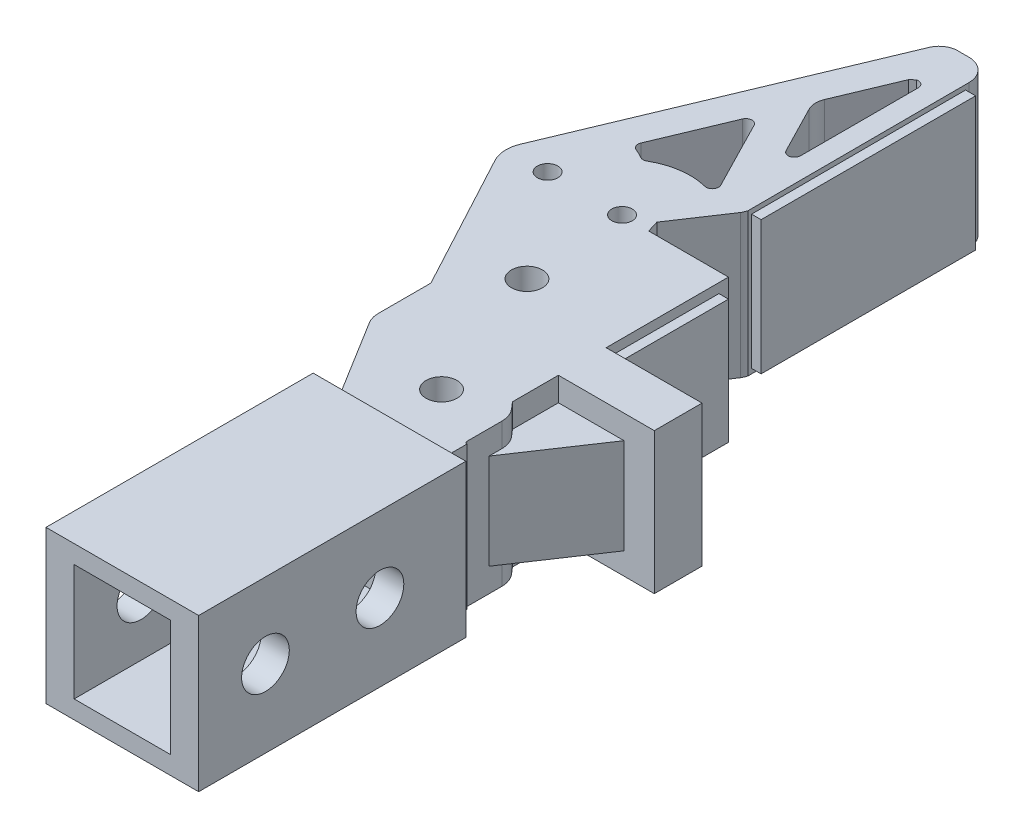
ISO-10303-21;
HEADER;
FILE_DESCRIPTION(('STEP AP214'),'2;1');
FILE_NAME('part.step','',(''),(''),'','','');
FILE_SCHEMA(('AUTOMOTIVE_DESIGN { 1 0 10303 214 1 1 1 1 }'));
ENDSEC;
DATA;
#1=APPLICATION_CONTEXT('core data for automotive mechanical design processes');
#2=APPLICATION_PROTOCOL_DEFINITION('international standard','automotive_design',2000,#1);
#3=PRODUCT_CONTEXT('',#1,'mechanical');
#4=PRODUCT('Part','Part','',(#3));
#5=PRODUCT_RELATED_PRODUCT_CATEGORY('part','',(#4));
#6=PRODUCT_DEFINITION_FORMATION('','',#4);
#7=PRODUCT_DEFINITION_CONTEXT('part definition',#1,'design');
#8=PRODUCT_DEFINITION('design','',#6,#7);
#9=PRODUCT_DEFINITION_SHAPE('','',#8);
#10=(LENGTH_UNIT() NAMED_UNIT(*) SI_UNIT(.MILLI.,.METRE.));
#11=(NAMED_UNIT(*) PLANE_ANGLE_UNIT() SI_UNIT($,.RADIAN.));
#12=(NAMED_UNIT(*) SI_UNIT($,.STERADIAN.) SOLID_ANGLE_UNIT());
#13=UNCERTAINTY_MEASURE_WITH_UNIT(LENGTH_MEASURE(1.E-05),#10,'distance_accuracy_value','');
#14=(GEOMETRIC_REPRESENTATION_CONTEXT(3) GLOBAL_UNCERTAINTY_ASSIGNED_CONTEXT((#13)) GLOBAL_UNIT_ASSIGNED_CONTEXT((#10,
#11,#12)) REPRESENTATION_CONTEXT('',''));
#15=CARTESIAN_POINT('',(0.,0.,0.));
#16=DIRECTION('',(0.,0.,1.));
#17=DIRECTION('',(1.,0.,0.));
#18=AXIS2_PLACEMENT_3D('',#15,#16,#17);
#19=CARTESIAN_POINT('',(32.2394319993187,-7.5,0.));
#20=DIRECTION('',(-1.,0.,0.));
#21=DIRECTION('',(0.,0.,1.));
#22=AXIS2_PLACEMENT_3D('',#19,#20,#21);
#23=PLANE('',#22);
#24=DIRECTION('',(0.,-1.,0.));
#25=VECTOR('',#24,1.);
#26=CARTESIAN_POINT('',(32.2394319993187,6.5,90.644087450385));
#27=LINE('',#26,#25);
#28=CARTESIAN_POINT('',(32.2394319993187,6.5,90.644087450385));
#29=VERTEX_POINT('',#28);
#30=CARTESIAN_POINT('',(32.2394319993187,-6.5,90.644087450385));
#31=VERTEX_POINT('',#30);
#32=EDGE_CURVE('E546',#29,#31,#27,.T.);
#33=ORIENTED_EDGE('',*,*,#32,.F.);
#34=DIRECTION('',(0.,0.,1.));
#35=VECTOR('',#34,1.);
#36=CARTESIAN_POINT('',(32.2394319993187,6.5,90.644087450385));
#37=LINE('',#36,#35);
#38=CARTESIAN_POINT('',(32.2394319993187,6.5,79.8216497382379));
#39=VERTEX_POINT('',#38);
#40=EDGE_CURVE('E551',#39,#29,#37,.T.);
#41=ORIENTED_EDGE('',*,*,#40,.F.);
#42=DIRECTION('',(0.,1.,0.));
#43=VECTOR('',#42,1.);
#44=CARTESIAN_POINT('',(32.2394319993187,6.5,79.8216497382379));
#45=LINE('',#44,#43);
#46=CARTESIAN_POINT('',(32.2394319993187,-6.5,79.8216497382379));
#47=VERTEX_POINT('',#46);
#48=EDGE_CURVE('E563',#47,#39,#45,.T.);
#49=ORIENTED_EDGE('',*,*,#48,.F.);
#50=DIRECTION('',(0.,0.,-1.));
#51=VECTOR('',#50,1.);
#52=CARTESIAN_POINT('',(32.2394319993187,-6.5,90.644087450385));
#53=LINE('',#52,#51);
#54=EDGE_CURVE('E560',#31,#47,#53,.T.);
#55=ORIENTED_EDGE('',*,*,#54,.F.);
#56=EDGE_LOOP('',(#33,#41,#49,#55));
#57=FACE_BOUND('',#56,.T.);
#58=DIRECTION('',(0.,0.,1.));
#59=VECTOR('',#58,1.);
#60=CARTESIAN_POINT('',(32.2394319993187,-5.,96.6440874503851));
#61=LINE('',#60,#59);
#62=CARTESIAN_POINT('',(32.2394319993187,-5.,96.6440874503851));
#63=VERTEX_POINT('',#62);
#64=CARTESIAN_POINT('',(32.2394319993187,-5.,101.462272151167));
#65=VERTEX_POINT('',#64);
#66=EDGE_CURVE('E67',#63,#65,#61,.T.);
#67=ORIENTED_EDGE('',*,*,#66,.T.);
#68=DIRECTION('',(0.,1.,0.));
#69=VECTOR('',#68,1.);
#70=CARTESIAN_POINT('',(32.2394319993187,-7.5,101.462272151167));
#71=LINE('',#70,#69);
#72=CARTESIAN_POINT('',(32.2394319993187,-7.5,101.462272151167));
#73=VERTEX_POINT('',#72);
#74=EDGE_CURVE('E692',#73,#65,#71,.T.);
#75=ORIENTED_EDGE('',*,*,#74,.F.);
#76=DIRECTION('',(0.,0.,1.));
#77=VECTOR('',#76,1.);
#78=CARTESIAN_POINT('',(32.2394319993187,-7.5,0.));
#79=LINE('',#78,#77);
#80=CARTESIAN_POINT('',(32.2394319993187,-7.5,78.8216497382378));
#81=VERTEX_POINT('',#80);
#82=EDGE_CURVE('E682',#81,#73,#79,.T.);
#83=ORIENTED_EDGE('',*,*,#82,.F.);
#84=DIRECTION('',(0.,1.,0.));
#85=VECTOR('',#84,1.);
#86=CARTESIAN_POINT('',(32.2394319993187,-7.5,78.8216497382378));
#87=LINE('',#86,#85);
#88=CARTESIAN_POINT('',(32.2394319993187,7.5,78.8216497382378));
#89=VERTEX_POINT('',#88);
#90=EDGE_CURVE('E688',#81,#89,#87,.T.);
#91=ORIENTED_EDGE('',*,*,#90,.T.);
#92=DIRECTION('',(0.,0.,1.));
#93=VECTOR('',#92,1.);
#94=CARTESIAN_POINT('',(32.2394319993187,7.5,0.));
#95=LINE('',#94,#93);
#96=CARTESIAN_POINT('',(32.2394319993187,7.5,91.644087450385));
#97=VERTEX_POINT('',#96);
#98=EDGE_CURVE('E689',#89,#97,#95,.T.);
#99=ORIENTED_EDGE('',*,*,#98,.T.);
#100=DIRECTION('',(0.,1.,0.));
#101=VECTOR('',#100,1.);
#102=CARTESIAN_POINT('',(32.2394319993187,-7.30000000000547,91.644087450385));
#103=LINE('',#102,#101);
#104=CARTESIAN_POINT('',(32.2394319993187,-7.30000000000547,91.644087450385));
#105=VERTEX_POINT('',#104);
#106=EDGE_CURVE('E584',#105,#97,#103,.T.);
#107=ORIENTED_EDGE('',*,*,#106,.F.);
#108=DIRECTION('',(0.,0.,-1.));
#109=VECTOR('',#108,1.);
#110=CARTESIAN_POINT('',(32.2394319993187,-7.30000000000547,96.6440874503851));
#111=LINE('',#110,#109);
#112=CARTESIAN_POINT('',(32.2394319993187,-7.30000000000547,96.6440874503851));
#113=VERTEX_POINT('',#112);
#114=EDGE_CURVE('E593',#113,#105,#111,.T.);
#115=ORIENTED_EDGE('',*,*,#114,.F.);
#116=DIRECTION('',(0.,-1.,0.));
#117=VECTOR('',#116,1.);
#118=CARTESIAN_POINT('',(32.2394319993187,7.5,96.6440874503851));
#119=LINE('',#118,#117);
#120=EDGE_CURVE('E579',#63,#113,#119,.T.);
#121=ORIENTED_EDGE('',*,*,#120,.F.);
#122=EDGE_LOOP('',(#67,#75,#83,#91,#99,#107,#115,#121));
#123=FACE_BOUND('',#122,.T.);
#124=ADVANCED_FACE('F42',(#57,#123),#23,.F.);
#125=CARTESIAN_POINT('',(-31.8006601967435,7.5,27.5550501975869));
#126=DIRECTION('',(0.755754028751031,0.,-0.654855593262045));
#127=DIRECTION('',(-0.654855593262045,0.,-0.755754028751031));
#128=AXIS2_PLACEMENT_3D('',#125,#126,#127);
#129=PLANE('',#128);
#130=ORIENTED_EDGE('',*,*,#74,.T.);
#131=DIRECTION('',(0.654855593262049,0.,0.755754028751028));
#132=VECTOR('',#131,1.);
#133=CARTESIAN_POINT('',(32.2394319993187,-5.,101.462272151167));
#134=LINE('',#133,#132);
#135=CARTESIAN_POINT('',(32.8286263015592,-5.,102.142247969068));
#136=VERTEX_POINT('',#135);
#137=EDGE_CURVE('E477',#65,#136,#134,.T.);
#138=ORIENTED_EDGE('',*,*,#137,.T.);
#139=DIRECTION('',(0.,-1.,0.));
#140=VECTOR('',#139,1.);
#141=CARTESIAN_POINT('',(32.8286263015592,7.5,102.142247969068));
#142=LINE('',#141,#140);
#143=CARTESIAN_POINT('',(32.8286263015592,-7.5,102.142247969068));
#144=VERTEX_POINT('',#143);
#145=EDGE_CURVE('E961',#136,#144,#142,.T.);
#146=ORIENTED_EDGE('',*,*,#145,.T.);
#147=DIRECTION('',(0.654855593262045,0.,0.755754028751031));
#148=VECTOR('',#147,1.);
#149=CARTESIAN_POINT('',(-31.8006601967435,-7.5,27.5550501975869));
#150=LINE('',#149,#148);
#151=EDGE_CURVE('E827',#73,#144,#150,.T.);
#152=ORIENTED_EDGE('',*,*,#151,.F.);
#153=EDGE_LOOP('',(#130,#138,#146,#152));
#154=FACE_BOUND('',#153,.T.);
#155=ADVANCED_FACE('F1089',(#154),#129,.T.);
#156=CARTESIAN_POINT('',(30.9392412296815,7.5,103.779386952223));
#157=DIRECTION('',(0.,-1.,0.));
#158=DIRECTION('',(0.,0.,-1.));
#159=AXIS2_PLACEMENT_3D('',#156,#157,#158);
#160=CYLINDRICAL_SURFACE('',#159,2.50000000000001);
#161=CARTESIAN_POINT('',(30.9392412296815,-5.,103.779386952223));
#162=DIRECTION('',(0.,-1.,0.));
#163=DIRECTION('',(0.,0.,1.));
#164=AXIS2_PLACEMENT_3D('',#161,#162,#163);
#165=CIRCLE('',#164,2.50000000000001);
#166=CARTESIAN_POINT('',(33.4392412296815,-5.,103.779386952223));
#167=VERTEX_POINT('',#166);
#168=EDGE_CURVE('E482',#136,#167,#165,.T.);
#169=ORIENTED_EDGE('',*,*,#168,.T.);
#170=DIRECTION('',(0.,-1.,0.));
#171=VECTOR('',#170,1.);
#172=CARTESIAN_POINT('',(33.4392412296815,7.5,103.779386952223));
#173=LINE('',#172,#171);
#174=CARTESIAN_POINT('',(33.4392412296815,-7.5,103.779386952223));
#175=VERTEX_POINT('',#174);
#176=EDGE_CURVE('E964',#167,#175,#173,.T.);
#177=ORIENTED_EDGE('',*,*,#176,.T.);
#178=CARTESIAN_POINT('',(30.9392412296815,-7.5,103.779386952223));
#179=DIRECTION('',(0.,1.,0.));
#180=DIRECTION('',(0.,0.,1.));
#181=AXIS2_PLACEMENT_3D('',#178,#179,#180);
#182=CIRCLE('',#181,2.50000000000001);
#183=EDGE_CURVE('E824',#175,#144,#182,.T.);
#184=ORIENTED_EDGE('',*,*,#183,.T.);
#185=ORIENTED_EDGE('',*,*,#145,.F.);
#186=EDGE_LOOP('',(#169,#177,#184,#185));
#187=FACE_BOUND('',#186,.T.);
#188=ADVANCED_FACE('F1086',(#187),#160,.T.);
#189=CARTESIAN_POINT('',(49.6903881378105,0.099999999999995,118.799185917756));
#190=DIRECTION('',(-1.,0.,0.));
#191=DIRECTION('',(0.,-1.,0.));
#192=AXIS2_PLACEMENT_3D('',#189,#190,#191);
#193=CYLINDRICAL_SURFACE('',#192,2.49999999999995);
#194=CARTESIAN_POINT('',(32.7403881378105,0.099999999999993,118.799185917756));
#195=DIRECTION('',(1.,0.,0.));
#196=DIRECTION('',(0.,0.,-1.));
#197=AXIS2_PLACEMENT_3D('',#194,#195,#196);
#198=CIRCLE('',#197,2.49999999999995);
#199=CARTESIAN_POINT('',(32.7403881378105,0.099999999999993,116.299185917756));
#200=VERTEX_POINT('',#199);
#201=EDGE_CURVE('E522',#200,#200,#198,.F.);
#202=ORIENTED_EDGE('',*,*,#201,.T.);
#203=EDGE_LOOP('',(#202));
#204=FACE_BOUND('',#203,.T.);
#205=CARTESIAN_POINT('',(35.6903881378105,0.0999999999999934,118.799185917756));
#206=DIRECTION('',(1.,0.,0.));
#207=DIRECTION('',(0.,0.,-1.));
#208=AXIS2_PLACEMENT_3D('',#205,#206,#207);
#209=CIRCLE('',#208,2.49999999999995);
#210=CARTESIAN_POINT('',(35.6903881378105,0.0999999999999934,116.299185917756));
#211=VERTEX_POINT('',#210);
#212=EDGE_CURVE('E645',#211,#211,#209,.T.);
#213=ORIENTED_EDGE('',*,*,#212,.T.);
#214=EDGE_LOOP('',(#213));
#215=FACE_BOUND('',#214,.T.);
#216=ADVANCED_FACE('F1010',(#204,#215),#193,.F.);
#217=CARTESIAN_POINT('',(49.6903881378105,0.1,130.799185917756));
#218=DIRECTION('',(-1.,0.,0.));
#219=DIRECTION('',(0.,-1.,0.));
#220=AXIS2_PLACEMENT_3D('',#217,#218,#219);
#221=CYLINDRICAL_SURFACE('',#220,2.49999999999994);
#222=CARTESIAN_POINT('',(32.7403881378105,0.0999999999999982,130.799185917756));
#223=DIRECTION('',(1.,0.,0.));
#224=DIRECTION('',(0.,0.,-1.));
#225=AXIS2_PLACEMENT_3D('',#222,#223,#224);
#226=CIRCLE('',#225,2.49999999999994);
#227=CARTESIAN_POINT('',(32.7403881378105,0.0999999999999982,128.299185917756));
#228=VERTEX_POINT('',#227);
#229=EDGE_CURVE('E46',#228,#228,#226,.F.);
#230=ORIENTED_EDGE('',*,*,#229,.T.);
#231=EDGE_LOOP('',(#230));
#232=FACE_BOUND('',#231,.T.);
#233=CARTESIAN_POINT('',(35.6903881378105,0.0999999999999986,130.799185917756));
#234=DIRECTION('',(1.,0.,0.));
#235=DIRECTION('',(0.,0.,-1.));
#236=AXIS2_PLACEMENT_3D('',#233,#234,#235);
#237=CIRCLE('',#236,2.49999999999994);
#238=CARTESIAN_POINT('',(35.6903881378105,0.0999999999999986,128.299185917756));
#239=VERTEX_POINT('',#238);
#240=EDGE_CURVE('E663',#239,#239,#237,.T.);
#241=ORIENTED_EDGE('',*,*,#240,.T.);
#242=EDGE_LOOP('',(#241));
#243=FACE_BOUND('',#242,.T.);
#244=ADVANCED_FACE('F1189',(#232,#243),#221,.F.);
#245=CARTESIAN_POINT('',(-32.8100160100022,7.5,20.2791674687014));
#246=DIRECTION('',(-0.850633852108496,0.,0.525758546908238));
#247=DIRECTION('',(0.525758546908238,0.,0.850633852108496));
#248=AXIS2_PLACEMENT_3D('',#245,#246,#247);
#249=PLANE('',#248);
#250=DIRECTION('',(0.,-1.,0.));
#251=VECTOR('',#250,1.);
#252=CARTESIAN_POINT('',(20.2924948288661,5.,106.194638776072));
#253=LINE('',#252,#251);
#254=CARTESIAN_POINT('',(20.2924948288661,5.,106.194638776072));
#255=VERTEX_POINT('',#254);
#256=CARTESIAN_POINT('',(20.2924948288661,-5.,106.194638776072));
#257=VERTEX_POINT('',#256);
#258=EDGE_CURVE('E543',#255,#257,#253,.T.);
#259=ORIENTED_EDGE('',*,*,#258,.F.);
#260=DIRECTION('',(-0.525758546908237,0.,-0.850633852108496));
#261=VECTOR('',#260,1.);
#262=CARTESIAN_POINT('',(20.2924948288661,5.,106.194638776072));
#263=LINE('',#262,#261);
#264=CARTESIAN_POINT('',(22.5203881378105,5.,109.799185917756));
#265=VERTEX_POINT('',#264);
#266=EDGE_CURVE('E529',#265,#255,#263,.T.);
#267=ORIENTED_EDGE('',*,*,#266,.F.);
#268=DIRECTION('',(0.,-1.,0.));
#269=VECTOR('',#268,1.);
#270=CARTESIAN_POINT('',(22.5203881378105,7.5,109.799185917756));
#271=LINE('',#270,#269);
#272=CARTESIAN_POINT('',(22.5203881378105,7.5,109.799185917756));
#273=VERTEX_POINT('',#272);
#274=EDGE_CURVE('E976',#273,#265,#271,.T.);
#275=ORIENTED_EDGE('',*,*,#274,.F.);
#276=DIRECTION('',(-0.525758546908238,0.,-0.850633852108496));
#277=VECTOR('',#276,1.);
#278=CARTESIAN_POINT('',(-32.8100160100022,7.5,20.2791674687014));
#279=LINE('',#278,#277);
#280=CARTESIAN_POINT('',(17.5626518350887,7.5,101.77797855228));
#281=VERTEX_POINT('',#280);
#282=EDGE_CURVE('E706',#273,#281,#279,.T.);
#283=ORIENTED_EDGE('',*,*,#282,.T.);
#284=DIRECTION('',(0.,-1.,0.));
#285=VECTOR('',#284,1.);
#286=CARTESIAN_POINT('',(17.5626518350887,7.5,101.77797855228));
#287=LINE('',#286,#285);
#288=CARTESIAN_POINT('',(17.5626518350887,-7.5,101.77797855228));
#289=VERTEX_POINT('',#288);
#290=EDGE_CURVE('E979',#281,#289,#287,.T.);
#291=ORIENTED_EDGE('',*,*,#290,.T.);
#292=DIRECTION('',(-0.525758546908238,0.,-0.850633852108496));
#293=VECTOR('',#292,1.);
#294=CARTESIAN_POINT('',(-32.8100160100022,-7.5,20.2791674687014));
#295=LINE('',#294,#293);
#296=CARTESIAN_POINT('',(22.5203881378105,-7.5,109.799185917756));
#297=VERTEX_POINT('',#296);
#298=EDGE_CURVE('E810',#297,#289,#295,.T.);
#299=ORIENTED_EDGE('',*,*,#298,.F.);
#300=CARTESIAN_POINT('',(22.5203881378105,-5.,109.799185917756));
#301=VERTEX_POINT('',#300);
#302=EDGE_CURVE('E975',#301,#297,#271,.T.);
#303=ORIENTED_EDGE('',*,*,#302,.F.);
#304=DIRECTION('',(-0.525758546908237,0.,-0.850633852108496));
#305=VECTOR('',#304,1.);
#306=CARTESIAN_POINT('',(20.2924948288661,-5.,106.194638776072));
#307=LINE('',#306,#305);
#308=EDGE_CURVE('E538',#301,#257,#307,.T.);
#309=ORIENTED_EDGE('',*,*,#308,.T.);
#310=EDGE_LOOP('',(#259,#267,#275,#283,#291,#299,#303,#309));
#311=FACE_BOUND('',#310,.T.);
#312=ADVANCED_FACE('F1041',(#311),#249,.T.);
#313=CARTESIAN_POINT('',(0.,0.,109.799185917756));
#314=DIRECTION('',(0.,0.,-1.));
#315=DIRECTION('',(-1.,0.,0.));
#316=AXIS2_PLACEMENT_3D('',#313,#314,#315);
#317=PLANE('',#316);
#318=ORIENTED_EDGE('',*,*,#274,.T.);
#319=DIRECTION('',(1.,0.,0.));
#320=VECTOR('',#319,1.);
#321=CARTESIAN_POINT('',(22.5203881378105,5.,109.799185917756));
#322=LINE('',#321,#320);
#323=CARTESIAN_POINT('',(19.6903881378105,5.,109.799185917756));
#324=VERTEX_POINT('',#323);
#325=EDGE_CURVE('E526',#324,#265,#322,.T.);
#326=ORIENTED_EDGE('',*,*,#325,.F.);
#327=DIRECTION('',(0.,-1.,0.));
#328=VECTOR('',#327,1.);
#329=CARTESIAN_POINT('',(19.6903881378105,8.,109.799185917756));
#330=LINE('',#329,#328);
#331=CARTESIAN_POINT('',(19.6903881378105,8.,109.799185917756));
#332=VERTEX_POINT('',#331);
#333=EDGE_CURVE('E652',#332,#324,#330,.T.);
#334=ORIENTED_EDGE('',*,*,#333,.F.);
#335=DIRECTION('',(1.,0.,0.));
#336=VECTOR('',#335,1.);
#337=CARTESIAN_POINT('',(19.6903881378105,8.,109.799185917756));
#338=LINE('',#337,#336);
#339=CARTESIAN_POINT('',(35.6903881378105,8.,109.799185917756));
#340=VERTEX_POINT('',#339);
#341=EDGE_CURVE('E660',#332,#340,#338,.T.);
#342=ORIENTED_EDGE('',*,*,#341,.T.);
#343=DIRECTION('',(0.,-1.,0.));
#344=VECTOR('',#343,1.);
#345=CARTESIAN_POINT('',(35.6903881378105,8.,109.799185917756));
#346=LINE('',#345,#344);
#347=CARTESIAN_POINT('',(35.6903881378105,-8.,109.799185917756));
#348=VERTEX_POINT('',#347);
#349=EDGE_CURVE('E662',#340,#348,#346,.T.);
#350=ORIENTED_EDGE('',*,*,#349,.T.);
#351=DIRECTION('',(1.,0.,0.));
#352=VECTOR('',#351,1.);
#353=CARTESIAN_POINT('',(19.6903881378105,-8.,109.799185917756));
#354=LINE('',#353,#352);
#355=CARTESIAN_POINT('',(19.6903881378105,-8.,109.799185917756));
#356=VERTEX_POINT('',#355);
#357=EDGE_CURVE('E666',#356,#348,#354,.T.);
#358=ORIENTED_EDGE('',*,*,#357,.F.);
#359=CARTESIAN_POINT('',(19.6903881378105,-5.,109.799185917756));
#360=VERTEX_POINT('',#359);
#361=EDGE_CURVE('E668',#360,#356,#330,.T.);
#362=ORIENTED_EDGE('',*,*,#361,.F.);
#363=DIRECTION('',(1.,0.,0.));
#364=VECTOR('',#363,1.);
#365=CARTESIAN_POINT('',(22.5203881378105,-5.,109.799185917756));
#366=LINE('',#365,#364);
#367=EDGE_CURVE('E525',#360,#301,#366,.T.);
#368=ORIENTED_EDGE('',*,*,#367,.T.);
#369=ORIENTED_EDGE('',*,*,#302,.T.);
#370=DIRECTION('',(1.,0.,0.));
#371=VECTOR('',#370,1.);
#372=CARTESIAN_POINT('',(0.,-7.5,109.799185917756));
#373=LINE('',#372,#371);
#374=CARTESIAN_POINT('',(33.6892364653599,-7.5,109.799185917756));
#375=VERTEX_POINT('',#374);
#376=EDGE_CURVE('E813',#297,#375,#373,.T.);
#377=ORIENTED_EDGE('',*,*,#376,.T.);
#378=DIRECTION('',(0.,-1.,0.));
#379=VECTOR('',#378,1.);
#380=CARTESIAN_POINT('',(33.6892364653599,7.5,109.799185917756));
#381=LINE('',#380,#379);
#382=CARTESIAN_POINT('',(33.6892364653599,7.5,109.799185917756));
#383=VERTEX_POINT('',#382);
#384=EDGE_CURVE('E972',#383,#375,#381,.T.);
#385=ORIENTED_EDGE('',*,*,#384,.F.);
#386=DIRECTION('',(1.,0.,0.));
#387=VECTOR('',#386,1.);
#388=CARTESIAN_POINT('',(0.,7.5,109.799185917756));
#389=LINE('',#388,#387);
#390=EDGE_CURVE('E709',#273,#383,#389,.T.);
#391=ORIENTED_EDGE('',*,*,#390,.F.);
#392=EDGE_LOOP('',(#318,#326,#334,#342,#350,#358,#362,#368,#369,#377,#385,#391));
#393=FACE_BOUND('',#392,.T.);
#394=ADVANCED_FACE('F1037',(#393),#317,.T.);
#395=CARTESIAN_POINT('',(32.2394319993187,5.,101.462272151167));
#396=VERTEX_POINT('',#395);
#397=CARTESIAN_POINT('',(32.2394319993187,7.5,101.462272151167));
#398=VERTEX_POINT('',#397);
#399=EDGE_CURVE('E695',#396,#398,#71,.T.);
#400=ORIENTED_EDGE('',*,*,#399,.F.);
#401=DIRECTION('',(0.,0.,1.));
#402=VECTOR('',#401,1.);
#403=CARTESIAN_POINT('',(32.2394319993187,5.,96.6440874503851));
#404=LINE('',#403,#402);
#405=CARTESIAN_POINT('',(32.2394319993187,5.,96.6440874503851));
#406=VERTEX_POINT('',#405);
#407=EDGE_CURVE('E1078',#406,#396,#404,.T.);
#408=ORIENTED_EDGE('',*,*,#407,.F.);
#409=CARTESIAN_POINT('',(32.2394319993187,7.5,96.6440874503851));
#410=VERTEX_POINT('',#409);
#411=EDGE_CURVE('E591',#410,#406,#119,.T.);
#412=ORIENTED_EDGE('',*,*,#411,.F.);
#413=EDGE_CURVE('E673',#410,#398,#95,.T.);
#414=ORIENTED_EDGE('',*,*,#413,.T.);
#415=EDGE_LOOP('',(#400,#408,#412,#414));
#416=FACE_BOUND('',#415,.T.);
#417=ADVANCED_FACE('F1096',(#416),#23,.F.);
#418=CARTESIAN_POINT('',(27.0786159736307,7.5,-0.0604173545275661));
#419=DIRECTION('',(0.999997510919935,0.,-0.00223117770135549));
#420=DIRECTION('',(-0.00223117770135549,0.,-0.999997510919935));
#421=AXIS2_PLACEMENT_3D('',#418,#419,#420);
#422=PLANE('',#421);
#423=DIRECTION('',(0.00223117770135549,0.,0.999997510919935));
#424=VECTOR('',#423,1.);
#425=CARTESIAN_POINT('',(27.0786159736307,-7.5,-0.0604173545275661));
#426=LINE('',#425,#424);
#427=CARTESIAN_POINT('',(27.1870954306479,-7.5,48.5592810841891));
#428=VERTEX_POINT('',#427);
#429=CARTESIAN_POINT('',(27.238897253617,-7.5,71.7764788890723));
#430=VERTEX_POINT('',#429);
#431=EDGE_CURVE('E839',#428,#430,#426,.T.);
#432=ORIENTED_EDGE('',*,*,#431,.F.);
#433=DIRECTION('',(0.,-1.,0.));
#434=VECTOR('',#433,1.);
#435=CARTESIAN_POINT('',(27.1870954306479,7.5,48.5592810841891));
#436=LINE('',#435,#434);
#437=CARTESIAN_POINT('',(27.1870954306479,7.5,48.5592810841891));
#438=VERTEX_POINT('',#437);
#439=EDGE_CURVE('E950',#438,#428,#436,.T.);
#440=ORIENTED_EDGE('',*,*,#439,.F.);
#441=DIRECTION('',(0.00223117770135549,0.,0.999997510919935));
#442=VECTOR('',#441,1.);
#443=CARTESIAN_POINT('',(27.0786159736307,7.5,-0.0604173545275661));
#444=LINE('',#443,#442);
#445=CARTESIAN_POINT('',(27.238897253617,7.5,71.7764788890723));
#446=VERTEX_POINT('',#445);
#447=EDGE_CURVE('E732',#438,#446,#444,.T.);
#448=ORIENTED_EDGE('',*,*,#447,.T.);
#449=DIRECTION('',(0.,-1.,0.));
#450=VECTOR('',#449,1.);
#451=CARTESIAN_POINT('',(27.238897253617,7.5,71.7764788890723));
#452=LINE('',#451,#450);
#453=EDGE_CURVE('E952',#446,#430,#452,.T.);
#454=ORIENTED_EDGE('',*,*,#453,.T.);
#455=EDGE_LOOP('',(#432,#440,#448,#454));
#456=FACE_BOUND('',#455,.T.);
#457=DIRECTION('',(0.,-1.,0.));
#458=VECTOR('',#457,1.);
#459=CARTESIAN_POINT('',(27.2380588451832,7.,71.4007103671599));
#460=LINE('',#459,#458);
#461=CARTESIAN_POINT('',(27.2380588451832,7.,71.4007103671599));
#462=VERTEX_POINT('',#461);
#463=CARTESIAN_POINT('',(27.2380588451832,-7.,71.4007103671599));
#464=VERTEX_POINT('',#463);
#465=EDGE_CURVE('E636',#462,#464,#460,.T.);
#466=ORIENTED_EDGE('',*,*,#465,.F.);
#467=DIRECTION('',(-0.00223117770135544,0.,-0.999997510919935));
#468=VECTOR('',#467,1.);
#469=CARTESIAN_POINT('',(27.1878978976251,7.,48.918940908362));
#470=LINE('',#469,#468);
#471=CARTESIAN_POINT('',(27.1878978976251,7.,48.918940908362));
#472=VERTEX_POINT('',#471);
#473=EDGE_CURVE('E620',#462,#472,#470,.T.);
#474=ORIENTED_EDGE('',*,*,#473,.T.);
#475=DIRECTION('',(0.,-1.,0.));
#476=VECTOR('',#475,1.);
#477=CARTESIAN_POINT('',(27.1878978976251,7.,48.918940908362));
#478=LINE('',#477,#476);
#479=CARTESIAN_POINT('',(27.1878978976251,-7.,48.918940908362));
#480=VERTEX_POINT('',#479);
#481=EDGE_CURVE('E633',#472,#480,#478,.T.);
#482=ORIENTED_EDGE('',*,*,#481,.T.);
#483=DIRECTION('',(-0.00223117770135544,0.,-0.999997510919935));
#484=VECTOR('',#483,1.);
#485=CARTESIAN_POINT('',(27.1878978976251,-7.,48.918940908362));
#486=LINE('',#485,#484);
#487=EDGE_CURVE('E614',#464,#480,#486,.T.);
#488=ORIENTED_EDGE('',*,*,#487,.F.);
#489=EDGE_LOOP('',(#466,#474,#482,#488));
#490=FACE_BOUND('',#489,.T.);
#491=ADVANCED_FACE('F1104',(#456,#490),#422,.T.);
#492=DIRECTION('',(0.654855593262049,0.,0.755754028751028));
#493=VECTOR('',#492,1.);
#494=CARTESIAN_POINT('',(32.2394319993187,5.,101.462272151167));
#495=LINE('',#494,#493);
#496=CARTESIAN_POINT('',(32.8286263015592,5.,102.142247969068));
#497=VERTEX_POINT('',#496);
#498=EDGE_CURVE('E59',#396,#497,#495,.T.);
#499=ORIENTED_EDGE('',*,*,#498,.F.);
#500=ORIENTED_EDGE('',*,*,#399,.T.);
#501=DIRECTION('',(0.654855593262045,0.,0.755754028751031));
#502=VECTOR('',#501,1.);
#503=CARTESIAN_POINT('',(-31.8006601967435,7.5,27.5550501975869));
#504=LINE('',#503,#502);
#505=CARTESIAN_POINT('',(32.8286263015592,7.5,102.142247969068));
#506=VERTEX_POINT('',#505);
#507=EDGE_CURVE('E723',#398,#506,#504,.T.);
#508=ORIENTED_EDGE('',*,*,#507,.T.);
#509=EDGE_CURVE('E962',#506,#497,#142,.T.);
#510=ORIENTED_EDGE('',*,*,#509,.T.);
#511=EDGE_LOOP('',(#499,#500,#508,#510));
#512=FACE_BOUND('',#511,.T.);
#513=ADVANCED_FACE('F1073',(#512),#129,.T.);
#514=CARTESIAN_POINT('',(24.3578683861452,7.5,51.6990320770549));
#515=DIRECTION('',(0.,-1.,0.));
#516=DIRECTION('',(0.,0.,-1.));
#517=AXIS2_PLACEMENT_3D('',#514,#515,#516);
#518=CYLINDRICAL_SURFACE('',#517,0.649999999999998);
#519=CARTESIAN_POINT('',(24.3578683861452,-7.5,51.6990320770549));
#520=DIRECTION('',(0.,1.,0.));
#521=DIRECTION('',(0.,0.,1.));
#522=AXIS2_PLACEMENT_3D('',#519,#520,#521);
#523=CIRCLE('',#522,0.649999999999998);
#524=CARTESIAN_POINT('',(25.0078683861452,-7.5,51.6990320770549));
#525=VERTEX_POINT('',#524);
#526=CARTESIAN_POINT('',(24.1950121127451,-7.5,51.0697643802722));
#527=VERTEX_POINT('',#526);
#528=EDGE_CURVE('E881',#525,#527,#523,.T.);
#529=ORIENTED_EDGE('',*,*,#528,.F.);
#530=DIRECTION('',(0.,-1.,0.));
#531=VECTOR('',#530,1.);
#532=CARTESIAN_POINT('',(25.0078683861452,7.5,51.6990320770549));
#533=LINE('',#532,#531);
#534=CARTESIAN_POINT('',(25.0078683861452,7.5,51.6990320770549));
#535=VERTEX_POINT('',#534);
#536=EDGE_CURVE('E12',#535,#525,#533,.T.);
#537=ORIENTED_EDGE('',*,*,#536,.F.);
#538=CARTESIAN_POINT('',(24.3578683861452,7.5,51.6990320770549));
#539=DIRECTION('',(0.,1.,0.));
#540=DIRECTION('',(0.,0.,1.));
#541=AXIS2_PLACEMENT_3D('',#538,#539,#540);
#542=CIRCLE('',#541,0.649999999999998);
#543=CARTESIAN_POINT('',(24.1950121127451,7.5,51.0697643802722));
#544=VERTEX_POINT('',#543);
#545=EDGE_CURVE('E770',#535,#544,#542,.T.);
#546=ORIENTED_EDGE('',*,*,#545,.T.);
#547=DIRECTION('',(0.,-1.,0.));
#548=VECTOR('',#547,1.);
#549=CARTESIAN_POINT('',(24.1950121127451,7.5,51.0697643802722));
#550=LINE('',#549,#548);
#551=EDGE_CURVE('E913',#544,#527,#550,.T.);
#552=ORIENTED_EDGE('',*,*,#551,.T.);
#553=EDGE_LOOP('',(#529,#537,#546,#552));
#554=FACE_BOUND('',#553,.T.);
#555=ADVANCED_FACE('F1198',(#554),#518,.F.);
#556=CARTESIAN_POINT('',(25.0078683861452,7.5,0.));
#557=DIRECTION('',(-1.,0.,0.));
#558=DIRECTION('',(0.,0.,1.));
#559=AXIS2_PLACEMENT_3D('',#556,#557,#558);
#560=PLANE('',#559);
#561=DIRECTION('',(0.,0.,-1.));
#562=VECTOR('',#561,1.);
#563=CARTESIAN_POINT('',(25.0078683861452,-7.5,0.));
#564=LINE('',#563,#562);
#565=CARTESIAN_POINT('',(25.0078683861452,-7.5,64.0323358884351));
#566=VERTEX_POINT('',#565);
#567=EDGE_CURVE('E884',#566,#525,#564,.T.);
#568=ORIENTED_EDGE('',*,*,#567,.F.);
#569=DIRECTION('',(0.,-1.,0.));
#570=VECTOR('',#569,1.);
#571=CARTESIAN_POINT('',(25.0078683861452,7.5,64.0323358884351));
#572=LINE('',#571,#570);
#573=CARTESIAN_POINT('',(25.0078683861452,7.5,64.0323358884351));
#574=VERTEX_POINT('',#573);
#575=EDGE_CURVE('E51',#574,#566,#572,.T.);
#576=ORIENTED_EDGE('',*,*,#575,.F.);
#577=DIRECTION('',(0.,0.,-1.));
#578=VECTOR('',#577,1.);
#579=CARTESIAN_POINT('',(25.0078683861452,7.5,0.));
#580=LINE('',#579,#578);
#581=EDGE_CURVE('E773',#574,#535,#580,.T.);
#582=ORIENTED_EDGE('',*,*,#581,.T.);
#583=ORIENTED_EDGE('',*,*,#536,.T.);
#584=EDGE_LOOP('',(#568,#576,#582,#583));
#585=FACE_BOUND('',#584,.T.);
#586=ADVANCED_FACE('F1253',(#585),#560,.T.);
#587=CARTESIAN_POINT('',(24.3578683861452,7.5,64.0323358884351));
#588=DIRECTION('',(0.,-1.,0.));
#589=DIRECTION('',(0.,0.,-1.));
#590=AXIS2_PLACEMENT_3D('',#587,#588,#589);
#591=CYLINDRICAL_SURFACE('',#590,0.649999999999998);
#592=CARTESIAN_POINT('',(24.3578683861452,-7.5,64.0323358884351));
#593=DIRECTION('',(0.,1.,0.));
#594=DIRECTION('',(0.,0.,1.));
#595=AXIS2_PLACEMENT_3D('',#592,#593,#594);
#596=CIRCLE('',#595,0.649999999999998);
#597=CARTESIAN_POINT('',(23.7797319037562,-7.5,64.3294187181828));
#598=VERTEX_POINT('',#597);
#599=EDGE_CURVE('E887',#598,#566,#596,.T.);
#600=ORIENTED_EDGE('',*,*,#599,.F.);
#601=DIRECTION('',(0.,-1.,0.));
#602=VECTOR('',#601,1.);
#603=CARTESIAN_POINT('',(23.7797319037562,7.5,64.3294187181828));
#604=LINE('',#603,#602);
#605=CARTESIAN_POINT('',(23.7797319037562,7.5,64.3294187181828));
#606=VERTEX_POINT('',#605);
#607=EDGE_CURVE('E922',#606,#598,#604,.T.);
#608=ORIENTED_EDGE('',*,*,#607,.F.);
#609=CARTESIAN_POINT('',(24.3578683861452,7.5,64.0323358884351));
#610=DIRECTION('',(0.,1.,0.));
#611=DIRECTION('',(0.,0.,1.));
#612=AXIS2_PLACEMENT_3D('',#609,#610,#611);
#613=CIRCLE('',#612,0.649999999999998);
#614=EDGE_CURVE('E776',#606,#574,#613,.T.);
#615=ORIENTED_EDGE('',*,*,#614,.T.);
#616=ORIENTED_EDGE('',*,*,#575,.T.);
#617=EDGE_LOOP('',(#600,#608,#615,#616));
#618=FACE_BOUND('',#617,.T.);
#619=ADVANCED_FACE('F1257',(#618),#591,.F.);
#620=CARTESIAN_POINT('',(-7.33889214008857,7.5,3.77118364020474));
#621=DIRECTION('',(0.889440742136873,0.,-0.45705050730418));
#622=DIRECTION('',(-0.45705050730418,0.,-0.889440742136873));
#623=AXIS2_PLACEMENT_3D('',#620,#621,#622);
#624=PLANE('',#623);
#625=DIRECTION('',(0.45705050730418,0.,0.889440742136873));
#626=VECTOR('',#625,1.);
#627=CARTESIAN_POINT('',(-7.33889214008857,-7.5,3.77118364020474));
#628=LINE('',#627,#626);
#629=CARTESIAN_POINT('',(21.2125945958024,-7.5,59.3336546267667));
#630=VERTEX_POINT('',#629);
#631=EDGE_CURVE('E890',#630,#598,#628,.T.);
#632=ORIENTED_EDGE('',*,*,#631,.F.);
#633=DIRECTION('',(0.,-1.,0.));
#634=VECTOR('',#633,1.);
#635=CARTESIAN_POINT('',(21.2125945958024,7.5,59.3336546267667));
#636=LINE('',#635,#634);
#637=CARTESIAN_POINT('',(21.2125945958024,7.5,59.3336546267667));
#638=VERTEX_POINT('',#637);
#639=EDGE_CURVE('E920',#638,#630,#636,.T.);
#640=ORIENTED_EDGE('',*,*,#639,.F.);
#641=DIRECTION('',(0.45705050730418,0.,0.889440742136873));
#642=VECTOR('',#641,1.);
#643=CARTESIAN_POINT('',(-7.33889214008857,7.5,3.77118364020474));
#644=LINE('',#643,#642);
#645=EDGE_CURVE('E779',#638,#606,#644,.T.);
#646=ORIENTED_EDGE('',*,*,#645,.T.);
#647=ORIENTED_EDGE('',*,*,#607,.T.);
#648=EDGE_LOOP('',(#632,#640,#646,#647));
#649=FACE_BOUND('',#648,.T.);
#650=ADVANCED_FACE('F1261',(#649),#624,.T.);
#651=CARTESIAN_POINT('',(22.9470040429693,7.5,58.4424061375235));
#652=DIRECTION('',(0.,-1.,0.));
#653=DIRECTION('',(0.,0.,-1.));
#654=AXIS2_PLACEMENT_3D('',#651,#652,#653);
#655=CYLINDRICAL_SURFACE('',#654,1.95);
#656=CARTESIAN_POINT('',(22.9470040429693,-7.5,58.4424061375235));
#657=DIRECTION('',(0.,1.,0.));
#658=DIRECTION('',(0.,0.,1.));
#659=AXIS2_PLACEMENT_3D('',#656,#657,#658);
#660=CIRCLE('',#659,1.95);
#661=CARTESIAN_POINT('',(21.1479732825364,-7.5,57.6900841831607));
#662=VERTEX_POINT('',#661);
#663=EDGE_CURVE('E893',#662,#630,#660,.T.);
#664=ORIENTED_EDGE('',*,*,#663,.F.);
#665=DIRECTION('',(0.,-1.,0.));
#666=VECTOR('',#665,1.);
#667=CARTESIAN_POINT('',(21.1479732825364,7.5,57.6900841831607));
#668=LINE('',#667,#666);
#669=CARTESIAN_POINT('',(21.1479732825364,7.5,57.6900841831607));
#670=VERTEX_POINT('',#669);
#671=EDGE_CURVE('E918',#670,#662,#668,.T.);
#672=ORIENTED_EDGE('',*,*,#671,.F.);
#673=CARTESIAN_POINT('',(22.9470040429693,7.5,58.4424061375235));
#674=DIRECTION('',(0.,1.,0.));
#675=DIRECTION('',(0.,0.,1.));
#676=AXIS2_PLACEMENT_3D('',#673,#674,#675);
#677=CIRCLE('',#676,1.95);
#678=EDGE_CURVE('E782',#670,#638,#677,.T.);
#679=ORIENTED_EDGE('',*,*,#678,.T.);
#680=ORIENTED_EDGE('',*,*,#639,.T.);
#681=EDGE_LOOP('',(#664,#672,#679,#680));
#682=FACE_BOUND('',#681,.T.);
#683=ADVANCED_FACE('F1265',(#682),#655,.F.);
#684=CARTESIAN_POINT('',(38.5342081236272,7.5,16.114305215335));
#685=DIRECTION('',(0.922579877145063,0.,0.385806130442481));
#686=DIRECTION('',(0.385806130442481,0.,-0.922579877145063));
#687=AXIS2_PLACEMENT_3D('',#684,#685,#686);
#688=PLANE('',#687);
#689=DIRECTION('',(-0.385806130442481,0.,0.922579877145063));
#690=VECTOR('',#689,1.);
#691=CARTESIAN_POINT('',(38.5342081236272,-7.5,16.114305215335));
#692=LINE('',#691,#690);
#693=CARTESIAN_POINT('',(23.7581914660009,-7.5,51.4482580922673));
#694=VERTEX_POINT('',#693);
#695=EDGE_CURVE('E896',#694,#662,#692,.T.);
#696=ORIENTED_EDGE('',*,*,#695,.F.);
#697=DIRECTION('',(0.,-1.,0.));
#698=VECTOR('',#697,1.);
#699=CARTESIAN_POINT('',(23.7581914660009,7.5,51.4482580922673));
#700=LINE('',#699,#698);
#701=CARTESIAN_POINT('',(23.7581914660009,7.5,51.4482580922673));
#702=VERTEX_POINT('',#701);
#703=EDGE_CURVE('E915',#702,#694,#700,.T.);
#704=ORIENTED_EDGE('',*,*,#703,.F.);
#705=DIRECTION('',(-0.385806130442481,0.,0.922579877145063));
#706=VECTOR('',#705,1.);
#707=CARTESIAN_POINT('',(38.5342081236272,7.5,16.114305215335));
#708=LINE('',#707,#706);
#709=EDGE_CURVE('E785',#702,#670,#708,.T.);
#710=ORIENTED_EDGE('',*,*,#709,.T.);
#711=ORIENTED_EDGE('',*,*,#671,.T.);
#712=EDGE_LOOP('',(#696,#704,#710,#711));
#713=FACE_BOUND('',#712,.T.);
#714=ADVANCED_FACE('F1222',(#713),#688,.T.);
#715=CARTESIAN_POINT('',(19.2191443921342,7.5,63.9872851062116));
#716=DIRECTION('',(0.,-1.,0.));
#717=DIRECTION('',(0.,0.,-1.));
#718=AXIS2_PLACEMENT_3D('',#715,#716,#717);
#719=CYLINDRICAL_SURFACE('',#718,0.65);
#720=CARTESIAN_POINT('',(19.2191443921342,-7.5,63.9872851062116));
#721=DIRECTION('',(0.,1.,0.));
#722=DIRECTION('',(0.,0.,1.));
#723=AXIS2_PLACEMENT_3D('',#720,#721,#722);
#724=CIRCLE('',#723,0.65);
#725=CARTESIAN_POINT('',(19.7972808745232,-7.5,63.6902022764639));
#726=VERTEX_POINT('',#725);
#727=CARTESIAN_POINT('',(18.6194674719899,-7.5,63.736511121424));
#728=VERTEX_POINT('',#727);
#729=EDGE_CURVE('E857',#726,#728,#724,.T.);
#730=ORIENTED_EDGE('',*,*,#729,.F.);
#731=DIRECTION('',(0.,-1.,0.));
#732=VECTOR('',#731,1.);
#733=CARTESIAN_POINT('',(19.7972808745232,7.5,63.6902022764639));
#734=LINE('',#733,#732);
#735=CARTESIAN_POINT('',(19.7972808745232,7.5,63.6902022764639));
#736=VERTEX_POINT('',#735);
#737=EDGE_CURVE('E916',#736,#726,#734,.T.);
#738=ORIENTED_EDGE('',*,*,#737,.F.);
#739=CARTESIAN_POINT('',(19.2191443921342,7.5,63.9872851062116));
#740=DIRECTION('',(0.,1.,0.));
#741=DIRECTION('',(0.,0.,1.));
#742=AXIS2_PLACEMENT_3D('',#739,#740,#741);
#743=CIRCLE('',#742,0.65);
#744=CARTESIAN_POINT('',(18.6194674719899,7.5,63.736511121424));
#745=VERTEX_POINT('',#744);
#746=EDGE_CURVE('E748',#736,#745,#743,.T.);
#747=ORIENTED_EDGE('',*,*,#746,.T.);
#748=DIRECTION('',(0.,-1.,0.));
#749=VECTOR('',#748,1.);
#750=CARTESIAN_POINT('',(18.6194674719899,7.5,63.736511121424));
#751=LINE('',#750,#749);
#752=EDGE_CURVE('E925',#745,#728,#751,.T.);
#753=ORIENTED_EDGE('',*,*,#752,.T.);
#754=EDGE_LOOP('',(#730,#738,#747,#753));
#755=FACE_BOUND('',#754,.T.);
#756=ADVANCED_FACE('F1218',(#755),#719,.F.);
#757=CARTESIAN_POINT('',(-10.2295745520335,7.5,5.25659778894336));
#758=DIRECTION('',(-0.889440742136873,0.,0.457050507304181));
#759=DIRECTION('',(0.457050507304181,0.,0.889440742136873));
#760=AXIS2_PLACEMENT_3D('',#757,#758,#759);
#761=PLANE('',#760);
#762=DIRECTION('',(-0.457050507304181,0.,-0.889440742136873));
#763=VECTOR('',#762,1.);
#764=CARTESIAN_POINT('',(-10.2295745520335,-7.5,5.25659778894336));
#765=LINE('',#764,#763);
#766=CARTESIAN_POINT('',(23.4981448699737,-7.5,70.8922492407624));
#767=VERTEX_POINT('',#766);
#768=EDGE_CURVE('E860',#767,#726,#765,.T.);
#769=ORIENTED_EDGE('',*,*,#768,.F.);
#770=DIRECTION('',(0.,-1.,0.));
#771=VECTOR('',#770,1.);
#772=CARTESIAN_POINT('',(23.4981448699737,7.5,70.8922492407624));
#773=LINE('',#772,#771);
#774=CARTESIAN_POINT('',(23.4981448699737,7.5,70.8922492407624));
#775=VERTEX_POINT('',#774);
#776=EDGE_CURVE('E938',#775,#767,#773,.T.);
#777=ORIENTED_EDGE('',*,*,#776,.F.);
#778=DIRECTION('',(-0.457050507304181,0.,-0.889440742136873));
#779=VECTOR('',#778,1.);
#780=CARTESIAN_POINT('',(-10.2295745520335,7.5,5.25659778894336));
#781=LINE('',#780,#779);
#782=EDGE_CURVE('E751',#775,#736,#781,.T.);
#783=ORIENTED_EDGE('',*,*,#782,.T.);
#784=ORIENTED_EDGE('',*,*,#737,.T.);
#785=EDGE_LOOP('',(#769,#777,#783,#784));
#786=FACE_BOUND('',#785,.T.);
#787=ADVANCED_FACE('F1221',(#786),#761,.T.);
#788=CARTESIAN_POINT('',(22.9200083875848,7.5,71.1893320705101));
#789=DIRECTION('',(0.,-1.,0.));
#790=DIRECTION('',(0.,0.,-1.));
#791=AXIS2_PLACEMENT_3D('',#788,#789,#790);
#792=CYLINDRICAL_SURFACE('',#791,0.649999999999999);
#793=CARTESIAN_POINT('',(22.9200083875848,-7.5,71.1893320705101));
#794=DIRECTION('',(0.,1.,0.));
#795=DIRECTION('',(0.,0.,1.));
#796=AXIS2_PLACEMENT_3D('',#793,#794,#795);
#797=CIRCLE('',#796,0.649999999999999);
#798=CARTESIAN_POINT('',(22.7613397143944,-7.5,71.8196686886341));
#799=VERTEX_POINT('',#798);
#800=EDGE_CURVE('E863',#799,#767,#797,.T.);
#801=ORIENTED_EDGE('',*,*,#800,.F.);
#802=DIRECTION('',(0.,-1.,0.));
#803=VECTOR('',#802,1.);
#804=CARTESIAN_POINT('',(22.7613397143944,7.5,71.8196686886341));
#805=LINE('',#804,#803);
#806=CARTESIAN_POINT('',(22.7613397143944,7.5,71.8196686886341));
#807=VERTEX_POINT('',#806);
#808=EDGE_CURVE('E936',#807,#799,#805,.T.);
#809=ORIENTED_EDGE('',*,*,#808,.F.);
#810=CARTESIAN_POINT('',(22.9200083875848,7.5,71.1893320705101));
#811=DIRECTION('',(0.,1.,0.));
#812=DIRECTION('',(0.,0.,1.));
#813=AXIS2_PLACEMENT_3D('',#810,#811,#812);
#814=CIRCLE('',#813,0.649999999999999);
#815=EDGE_CURVE('E754',#807,#775,#814,.T.);
#816=ORIENTED_EDGE('',*,*,#815,.T.);
#817=ORIENTED_EDGE('',*,*,#776,.T.);
#818=EDGE_LOOP('',(#801,#809,#816,#817));
#819=FACE_BOUND('',#818,.T.);
#820=ADVANCED_FACE('F1226',(#819),#792,.F.);
#821=CARTESIAN_POINT('',(21.0159843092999,7.5,78.7533714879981));
#822=DIRECTION('',(0.,-1.,0.));
#823=DIRECTION('',(0.,0.,-1.));
#824=AXIS2_PLACEMENT_3D('',#821,#822,#823);
#825=CYLINDRICAL_SURFACE('',#824,7.15000000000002);
#826=CARTESIAN_POINT('',(21.0159843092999,-7.5,78.7533714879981));
#827=DIRECTION('',(0.,1.,0.));
#828=DIRECTION('',(0.,0.,1.));
#829=AXIS2_PLACEMENT_3D('',#826,#827,#828);
#830=CIRCLE('',#829,7.15000000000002);
#831=CARTESIAN_POINT('',(17.4409843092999,-7.5,72.5612898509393));
#832=VERTEX_POINT('',#831);
#833=EDGE_CURVE('E866',#799,#832,#830,.T.);
#834=ORIENTED_EDGE('',*,*,#833,.T.);
#835=DIRECTION('',(0.,-1.,0.));
#836=VECTOR('',#835,1.);
#837=CARTESIAN_POINT('',(17.4409843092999,7.5,72.5612898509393));
#838=LINE('',#837,#836);
#839=CARTESIAN_POINT('',(17.4409843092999,7.5,72.5612898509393));
#840=VERTEX_POINT('',#839);
#841=EDGE_CURVE('E934',#840,#832,#838,.T.);
#842=ORIENTED_EDGE('',*,*,#841,.F.);
#843=CARTESIAN_POINT('',(21.0159843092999,7.5,78.7533714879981));
#844=DIRECTION('',(0.,1.,0.));
#845=DIRECTION('',(0.,0.,1.));
#846=AXIS2_PLACEMENT_3D('',#843,#844,#845);
#847=CIRCLE('',#846,7.15000000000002);
#848=EDGE_CURVE('E757',#807,#840,#847,.T.);
#849=ORIENTED_EDGE('',*,*,#848,.F.);
#850=ORIENTED_EDGE('',*,*,#808,.T.);
#851=EDGE_LOOP('',(#834,#842,#849,#850));
#852=FACE_BOUND('',#851,.T.);
#853=ADVANCED_FACE('F1230',(#852),#825,.T.);
#854=CARTESIAN_POINT('',(17.1159843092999,7.5,71.9983733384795));
#855=DIRECTION('',(0.,-1.,0.));
#856=DIRECTION('',(0.,0.,-1.));
#857=AXIS2_PLACEMENT_3D('',#854,#855,#856);
#858=CYLINDRICAL_SURFACE('',#857,0.649999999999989);
#859=CARTESIAN_POINT('',(17.1159843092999,-7.5,71.9983733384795));
#860=DIRECTION('',(0.,1.,0.));
#861=DIRECTION('',(0.,0.,1.));
#862=AXIS2_PLACEMENT_3D('',#859,#860,#861);
#863=CIRCLE('',#862,0.649999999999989);
#864=CARTESIAN_POINT('',(16.7909843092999,-7.5,72.5612898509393));
#865=VERTEX_POINT('',#864);
#866=EDGE_CURVE('E869',#865,#832,#863,.T.);
#867=ORIENTED_EDGE('',*,*,#866,.F.);
#868=DIRECTION('',(0.,-1.,0.));
#869=VECTOR('',#868,1.);
#870=CARTESIAN_POINT('',(16.7909843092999,7.5,72.5612898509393));
#871=LINE('',#870,#869);
#872=CARTESIAN_POINT('',(16.7909843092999,7.5,72.5612898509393));
#873=VERTEX_POINT('',#872);
#874=EDGE_CURVE('E932',#873,#865,#871,.T.);
#875=ORIENTED_EDGE('',*,*,#874,.F.);
#876=CARTESIAN_POINT('',(17.1159843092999,7.5,71.9983733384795));
#877=DIRECTION('',(0.,1.,0.));
#878=DIRECTION('',(0.,0.,1.));
#879=AXIS2_PLACEMENT_3D('',#876,#877,#878);
#880=CIRCLE('',#879,0.649999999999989);
#881=EDGE_CURVE('E759',#873,#840,#880,.T.);
#882=ORIENTED_EDGE('',*,*,#881,.T.);
#883=ORIENTED_EDGE('',*,*,#841,.T.);
#884=EDGE_LOOP('',(#867,#875,#882,#883));
#885=FACE_BOUND('',#884,.T.);
#886=ADVANCED_FACE('F1234',(#885),#858,.F.);
#887=CARTESIAN_POINT('',(13.2159843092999,7.5,78.7533714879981));
#888=DIRECTION('',(0.,-1.,0.));
#889=DIRECTION('',(0.,0.,-1.));
#890=AXIS2_PLACEMENT_3D('',#887,#888,#889);
#891=CYLINDRICAL_SURFACE('',#890,7.15000000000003);
#892=CARTESIAN_POINT('',(13.2159843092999,-7.5,78.7533714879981));
#893=DIRECTION('',(0.,1.,0.));
#894=DIRECTION('',(0.,0.,1.));
#895=AXIS2_PLACEMENT_3D('',#892,#893,#894);
#896=CIRCLE('',#895,7.15000000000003);
#897=CARTESIAN_POINT('',(15.8399263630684,-7.5,72.1022491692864));
#898=VERTEX_POINT('',#897);
#899=EDGE_CURVE('E872',#865,#898,#896,.T.);
#900=ORIENTED_EDGE('',*,*,#899,.T.);
#901=DIRECTION('',(0.,-1.,0.));
#902=VECTOR('',#901,1.);
#903=CARTESIAN_POINT('',(15.8399263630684,7.5,72.1022491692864));
#904=LINE('',#903,#902);
#905=CARTESIAN_POINT('',(15.8399263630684,7.5,72.1022491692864));
#906=VERTEX_POINT('',#905);
#907=EDGE_CURVE('E930',#906,#898,#904,.T.);
#908=ORIENTED_EDGE('',*,*,#907,.F.);
#909=CARTESIAN_POINT('',(13.2159843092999,7.5,78.7533714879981));
#910=DIRECTION('',(0.,1.,0.));
#911=DIRECTION('',(0.,0.,1.));
#912=AXIS2_PLACEMENT_3D('',#909,#910,#911);
#913=CIRCLE('',#912,7.15000000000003);
#914=EDGE_CURVE('E762',#873,#906,#913,.T.);
#915=ORIENTED_EDGE('',*,*,#914,.F.);
#916=ORIENTED_EDGE('',*,*,#874,.T.);
#917=EDGE_LOOP('',(#900,#908,#915,#916));
#918=FACE_BOUND('',#917,.T.);
#919=ADVANCED_FACE('F1238',(#918),#891,.T.);
#920=CARTESIAN_POINT('',(16.0784665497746,7.5,71.4976016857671));
#921=DIRECTION('',(0.,-1.,0.));
#922=DIRECTION('',(0.,0.,-1.));
#923=AXIS2_PLACEMENT_3D('',#920,#921,#922);
#924=CYLINDRICAL_SURFACE('',#923,0.649999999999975);
#925=CARTESIAN_POINT('',(16.0784665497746,-7.5,71.4976016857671));
#926=DIRECTION('',(0.,1.,0.));
#927=DIRECTION('',(0.,0.,1.));
#928=AXIS2_PLACEMENT_3D('',#925,#926,#927);
#929=CIRCLE('',#928,0.649999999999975);
#930=CARTESIAN_POINT('',(15.4787896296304,-7.5,71.2468277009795));
#931=VERTEX_POINT('',#930);
#932=EDGE_CURVE('E875',#931,#898,#929,.T.);
#933=ORIENTED_EDGE('',*,*,#932,.F.);
#934=DIRECTION('',(0.,-1.,0.));
#935=VECTOR('',#934,1.);
#936=CARTESIAN_POINT('',(15.4787896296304,7.5,71.2468277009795));
#937=LINE('',#936,#935);
#938=CARTESIAN_POINT('',(15.4787896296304,7.5,71.2468277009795));
#939=VERTEX_POINT('',#938);
#940=EDGE_CURVE('E927',#939,#931,#937,.T.);
#941=ORIENTED_EDGE('',*,*,#940,.F.);
#942=CARTESIAN_POINT('',(16.0784665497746,7.5,71.4976016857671));
#943=DIRECTION('',(0.,1.,0.));
#944=DIRECTION('',(0.,0.,1.));
#945=AXIS2_PLACEMENT_3D('',#942,#943,#944);
#946=CIRCLE('',#945,0.649999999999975);
#947=EDGE_CURVE('E764',#939,#906,#946,.T.);
#948=ORIENTED_EDGE('',*,*,#947,.T.);
#949=ORIENTED_EDGE('',*,*,#907,.T.);
#950=EDGE_LOOP('',(#933,#941,#948,#949));
#951=FACE_BOUND('',#950,.T.);
#952=ADVANCED_FACE('F1242',(#951),#924,.F.);
#953=CARTESIAN_POINT('',(-26.2153069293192,7.5,14.0665661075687));
#954=DIRECTION('',(-0.881162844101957,0.,0.472812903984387));
#955=DIRECTION('',(0.472812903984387,0.,0.881162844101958));
#956=AXIS2_PLACEMENT_3D('',#953,#954,#955);
#957=PLANE('',#956);
#958=DIRECTION('',(-0.472812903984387,0.,-0.881162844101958));
#959=VECTOR('',#958,1.);
#960=CARTESIAN_POINT('',(-26.2153069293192,-7.5,14.0665661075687));
#961=LINE('',#960,#959);
#962=CARTESIAN_POINT('',(17.1892364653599,-7.5,94.9579093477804));
#963=VERTEX_POINT('',#962);
#964=CARTESIAN_POINT('',(9.40707943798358,-7.5,80.4546088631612));
#965=VERTEX_POINT('',#964);
#966=EDGE_CURVE('E694',#963,#965,#961,.T.);
#967=ORIENTED_EDGE('',*,*,#966,.F.);
#968=DIRECTION('',(0.,-1.,0.));
#969=VECTOR('',#968,1.);
#970=CARTESIAN_POINT('',(17.1892364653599,7.5,94.9579093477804));
#971=LINE('',#970,#969);
#972=CARTESIAN_POINT('',(17.1892364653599,7.5,94.9579093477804));
#973=VERTEX_POINT('',#972);
#974=EDGE_CURVE('E928',#973,#963,#971,.T.);
#975=ORIENTED_EDGE('',*,*,#974,.F.);
#976=DIRECTION('',(-0.472812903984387,0.,-0.881162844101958));
#977=VECTOR('',#976,1.);
#978=CARTESIAN_POINT('',(-26.2153069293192,7.5,14.0665661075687));
#979=LINE('',#978,#977);
#980=CARTESIAN_POINT('',(9.40707943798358,7.5,80.4546088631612));
#981=VERTEX_POINT('',#980);
#982=EDGE_CURVE('E698',#973,#981,#979,.T.);
#983=ORIENTED_EDGE('',*,*,#982,.T.);
#984=DIRECTION('',(0.,-1.,0.));
#985=VECTOR('',#984,1.);
#986=CARTESIAN_POINT('',(9.40707943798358,7.5,80.4546088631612));
#987=LINE('',#986,#985);
#988=EDGE_CURVE('E802',#981,#965,#987,.T.);
#989=ORIENTED_EDGE('',*,*,#988,.T.);
#990=EDGE_LOOP('',(#967,#975,#983,#989));
#991=FACE_BOUND('',#990,.T.);
#992=ADVANCED_FACE('F44',(#991),#957,.T.);
#993=CARTESIAN_POINT('',(17.1892364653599,7.5,0.));
#994=DIRECTION('',(1.,0.,0.));
#995=DIRECTION('',(0.,0.,-1.));
#996=AXIS2_PLACEMENT_3D('',#993,#994,#995);
#997=PLANE('',#996);
#998=DIRECTION('',(0.,0.,1.));
#999=VECTOR('',#998,1.);
#1000=CARTESIAN_POINT('',(17.1892364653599,-7.5,0.));
#1001=LINE('',#1000,#999);
#1002=CARTESIAN_POINT('',(17.1892364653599,-7.5,100.46358218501));
#1003=VERTEX_POINT('',#1002);
#1004=EDGE_CURVE('E805',#963,#1003,#1001,.T.);
#1005=ORIENTED_EDGE('',*,*,#1004,.T.);
#1006=DIRECTION('',(0.,-1.,0.));
#1007=VECTOR('',#1006,1.);
#1008=CARTESIAN_POINT('',(17.1892364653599,7.5,100.46358218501));
#1009=LINE('',#1008,#1007);
#1010=CARTESIAN_POINT('',(17.1892364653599,7.5,100.46358218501));
#1011=VERTEX_POINT('',#1010);
#1012=EDGE_CURVE('E981',#1011,#1003,#1009,.T.);
#1013=ORIENTED_EDGE('',*,*,#1012,.F.);
#1014=DIRECTION('',(0.,0.,1.));
#1015=VECTOR('',#1014,1.);
#1016=CARTESIAN_POINT('',(17.1892364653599,7.5,0.));
#1017=LINE('',#1016,#1015);
#1018=EDGE_CURVE('E701',#973,#1011,#1017,.T.);
#1019=ORIENTED_EDGE('',*,*,#1018,.F.);
#1020=ORIENTED_EDGE('',*,*,#974,.T.);
#1021=EDGE_LOOP('',(#1005,#1013,#1019,#1020));
#1022=FACE_BOUND('',#1021,.T.);
#1023=ADVANCED_FACE('F1176',(#1022),#997,.F.);
#1024=CARTESIAN_POINT('',(19.6892364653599,7.5,100.46358218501));
#1025=DIRECTION('',(0.,-1.,0.));
#1026=DIRECTION('',(0.,0.,-1.));
#1027=AXIS2_PLACEMENT_3D('',#1024,#1025,#1026);
#1028=CYLINDRICAL_SURFACE('',#1027,2.50000000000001);
#1029=CARTESIAN_POINT('',(19.6892364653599,-7.5,100.46358218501));
#1030=DIRECTION('',(0.,1.,0.));
#1031=DIRECTION('',(0.,0.,1.));
#1032=AXIS2_PLACEMENT_3D('',#1029,#1030,#1031);
#1033=CIRCLE('',#1032,2.50000000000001);
#1034=EDGE_CURVE('E807',#1003,#289,#1033,.T.);
#1035=ORIENTED_EDGE('',*,*,#1034,.T.);
#1036=ORIENTED_EDGE('',*,*,#290,.F.);
#1037=CARTESIAN_POINT('',(19.6892364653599,7.5,100.46358218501));
#1038=DIRECTION('',(0.,1.,0.));
#1039=DIRECTION('',(0.,0.,1.));
#1040=AXIS2_PLACEMENT_3D('',#1037,#1038,#1039);
#1041=CIRCLE('',#1040,2.50000000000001);
#1042=EDGE_CURVE('E704',#1011,#281,#1041,.T.);
#1043=ORIENTED_EDGE('',*,*,#1042,.F.);
#1044=ORIENTED_EDGE('',*,*,#1012,.T.);
#1045=EDGE_LOOP('',(#1035,#1036,#1043,#1044));
#1046=FACE_BOUND('',#1045,.T.);
#1047=ADVANCED_FACE('F1179',(#1046),#1028,.T.);
#1048=CARTESIAN_POINT('',(33.6892364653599,7.5,0.));
#1049=DIRECTION('',(1.,0.,0.));
#1050=DIRECTION('',(0.,0.,-1.));
#1051=AXIS2_PLACEMENT_3D('',#1048,#1049,#1050);
#1052=PLANE('',#1051);
#1053=DIRECTION('',(0.,0.,1.));
#1054=VECTOR('',#1053,1.);
#1055=CARTESIAN_POINT('',(33.6892364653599,-7.5,0.));
#1056=LINE('',#1055,#1054);
#1057=CARTESIAN_POINT('',(33.6892364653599,-7.5,107.696944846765));
#1058=VERTEX_POINT('',#1057);
#1059=EDGE_CURVE('E815',#1058,#375,#1056,.T.);
#1060=ORIENTED_EDGE('',*,*,#1059,.F.);
#1061=DIRECTION('',(0.,-1.,0.));
#1062=VECTOR('',#1061,1.);
#1063=CARTESIAN_POINT('',(33.6892364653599,7.5,107.696944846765));
#1064=LINE('',#1063,#1062);
#1065=CARTESIAN_POINT('',(33.6892364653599,7.5,107.696944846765));
#1066=VERTEX_POINT('',#1065);
#1067=EDGE_CURVE('E970',#1066,#1058,#1064,.T.);
#1068=ORIENTED_EDGE('',*,*,#1067,.F.);
#1069=DIRECTION('',(0.,0.,1.));
#1070=VECTOR('',#1069,1.);
#1071=CARTESIAN_POINT('',(33.6892364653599,7.5,0.));
#1072=LINE('',#1071,#1070);
#1073=EDGE_CURVE('E711',#1066,#383,#1072,.T.);
#1074=ORIENTED_EDGE('',*,*,#1073,.T.);
#1075=ORIENTED_EDGE('',*,*,#384,.T.);
#1076=EDGE_LOOP('',(#1060,#1068,#1074,#1075));
#1077=FACE_BOUND('',#1076,.T.);
#1078=ADVANCED_FACE('F1052',(#1077),#1052,.T.);
#1079=CARTESIAN_POINT('',(33.6892412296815,7.5,107.446944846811));
#1080=DIRECTION('',(0.,-1.,0.));
#1081=DIRECTION('',(0.,0.,-1.));
#1082=AXIS2_PLACEMENT_3D('',#1079,#1080,#1081);
#1083=CYLINDRICAL_SURFACE('',#1082,0.250000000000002);
#1084=CARTESIAN_POINT('',(33.6892412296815,-7.5,107.446944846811));
#1085=DIRECTION('',(0.,1.,0.));
#1086=DIRECTION('',(0.,0.,1.));
#1087=AXIS2_PLACEMENT_3D('',#1084,#1085,#1086);
#1088=CIRCLE('',#1087,0.250000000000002);
#1089=CARTESIAN_POINT('',(33.4392412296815,-7.5,107.446944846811));
#1090=VERTEX_POINT('',#1089);
#1091=EDGE_CURVE('E818',#1090,#1058,#1088,.T.);
#1092=ORIENTED_EDGE('',*,*,#1091,.F.);
#1093=DIRECTION('',(0.,-1.,0.));
#1094=VECTOR('',#1093,1.);
#1095=CARTESIAN_POINT('',(33.4392412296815,7.5,107.446944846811));
#1096=LINE('',#1095,#1094);
#1097=CARTESIAN_POINT('',(33.4392412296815,7.5,107.446944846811));
#1098=VERTEX_POINT('',#1097);
#1099=EDGE_CURVE('E968',#1098,#1090,#1096,.T.);
#1100=ORIENTED_EDGE('',*,*,#1099,.F.);
#1101=CARTESIAN_POINT('',(33.6892412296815,7.5,107.446944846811));
#1102=DIRECTION('',(0.,1.,0.));
#1103=DIRECTION('',(0.,0.,1.));
#1104=AXIS2_PLACEMENT_3D('',#1101,#1102,#1103);
#1105=CIRCLE('',#1104,0.250000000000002);
#1106=EDGE_CURVE('E714',#1098,#1066,#1105,.T.);
#1107=ORIENTED_EDGE('',*,*,#1106,.T.);
#1108=ORIENTED_EDGE('',*,*,#1067,.T.);
#1109=EDGE_LOOP('',(#1092,#1100,#1107,#1108));
#1110=FACE_BOUND('',#1109,.T.);
#1111=ADVANCED_FACE('F1063',(#1110),#1083,.F.);
#1112=CARTESIAN_POINT('',(33.4392412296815,7.5,0.));
#1113=DIRECTION('',(1.,0.,0.));
#1114=DIRECTION('',(0.,0.,-1.));
#1115=AXIS2_PLACEMENT_3D('',#1112,#1113,#1114);
#1116=PLANE('',#1115);
#1117=DIRECTION('',(0.,0.,1.));
#1118=VECTOR('',#1117,1.);
#1119=CARTESIAN_POINT('',(33.4392412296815,5.,103.779386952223));
#1120=LINE('',#1119,#1118);
#1121=CARTESIAN_POINT('',(33.4392412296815,5.,103.779386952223));
#1122=VERTEX_POINT('',#1121);
#1123=CARTESIAN_POINT('',(33.4392412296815,5.,105.112102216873));
#1124=VERTEX_POINT('',#1123);
#1125=EDGE_CURVE('E483',#1122,#1124,#1120,.T.);
#1126=ORIENTED_EDGE('',*,*,#1125,.F.);
#1127=CARTESIAN_POINT('',(33.4392412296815,7.5,103.779386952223));
#1128=VERTEX_POINT('',#1127);
#1129=EDGE_CURVE('E965',#1128,#1122,#173,.T.);
#1130=ORIENTED_EDGE('',*,*,#1129,.F.);
#1131=DIRECTION('',(0.,0.,1.));
#1132=VECTOR('',#1131,1.);
#1133=CARTESIAN_POINT('',(33.4392412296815,7.5,0.));
#1134=LINE('',#1133,#1132);
#1135=EDGE_CURVE('E717',#1128,#1098,#1134,.T.);
#1136=ORIENTED_EDGE('',*,*,#1135,.T.);
#1137=ORIENTED_EDGE('',*,*,#1099,.T.);
#1138=DIRECTION('',(0.,0.,1.));
#1139=VECTOR('',#1138,1.);
#1140=CARTESIAN_POINT('',(33.4392412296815,-7.5,0.));
#1141=LINE('',#1140,#1139);
#1142=EDGE_CURVE('E821',#175,#1090,#1141,.T.);
#1143=ORIENTED_EDGE('',*,*,#1142,.F.);
#1144=ORIENTED_EDGE('',*,*,#176,.F.);
#1145=DIRECTION('',(0.,0.,1.));
#1146=VECTOR('',#1145,1.);
#1147=CARTESIAN_POINT('',(33.4392412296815,-5.,103.779386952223));
#1148=LINE('',#1147,#1146);
#1149=CARTESIAN_POINT('',(33.4392412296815,-5.,105.112102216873));
#1150=VERTEX_POINT('',#1149);
#1151=EDGE_CURVE('E472',#167,#1150,#1148,.T.);
#1152=ORIENTED_EDGE('',*,*,#1151,.T.);
#1153=DIRECTION('',(0.,-1.,0.));
#1154=VECTOR('',#1153,1.);
#1155=CARTESIAN_POINT('',(33.4392412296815,5.,105.112102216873));
#1156=LINE('',#1155,#1154);
#1157=EDGE_CURVE('E463',#1124,#1150,#1156,.T.);
#1158=ORIENTED_EDGE('',*,*,#1157,.F.);
#1159=EDGE_LOOP('',(#1126,#1130,#1136,#1137,#1143,#1144,#1152,#1158));
#1160=FACE_BOUND('',#1159,.T.);
#1161=ADVANCED_FACE('F1066',(#1160),#1116,.T.);
#1162=ORIENTED_EDGE('',*,*,#1129,.T.);
#1163=CARTESIAN_POINT('',(30.9392412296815,5.,103.779386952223));
#1164=DIRECTION('',(0.,-1.,0.));
#1165=DIRECTION('',(0.,0.,1.));
#1166=AXIS2_PLACEMENT_3D('',#1163,#1164,#1165);
#1167=CIRCLE('',#1166,2.50000000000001);
#1168=EDGE_CURVE('E464',#497,#1122,#1167,.T.);
#1169=ORIENTED_EDGE('',*,*,#1168,.F.);
#1170=ORIENTED_EDGE('',*,*,#509,.F.);
#1171=CARTESIAN_POINT('',(30.9392412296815,7.5,103.779386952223));
#1172=DIRECTION('',(0.,1.,0.));
#1173=DIRECTION('',(0.,0.,1.));
#1174=AXIS2_PLACEMENT_3D('',#1171,#1172,#1173);
#1175=CIRCLE('',#1174,2.50000000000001);
#1176=EDGE_CURVE('E720',#1128,#506,#1175,.T.);
#1177=ORIENTED_EDGE('',*,*,#1176,.F.);
#1178=EDGE_LOOP('',(#1162,#1169,#1170,#1177));
#1179=FACE_BOUND('',#1178,.T.);
#1180=ADVANCED_FACE('F1071',(#1179),#160,.T.);
#1181=CARTESIAN_POINT('',(-0.455543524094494,7.5,0.140891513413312));
#1182=DIRECTION('',(-0.955351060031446,0.,0.29547309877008));
#1183=DIRECTION('',(0.29547309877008,0.,0.955351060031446));
#1184=AXIS2_PLACEMENT_3D('',#1181,#1182,#1183);
#1185=PLANE('',#1184);
#1186=DIRECTION('',(-0.29547309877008,0.,-0.955351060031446));
#1187=VECTOR('',#1186,1.);
#1188=CARTESIAN_POINT('',(-0.455543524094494,-7.5,0.140891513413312));
#1189=LINE('',#1188,#1187);
#1190=CARTESIAN_POINT('',(23.8790162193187,-7.5,78.8216497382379));
#1191=VERTEX_POINT('',#1190);
#1192=CARTESIAN_POINT('',(23.4981448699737,-7.5,77.5901811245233));
#1193=VERTEX_POINT('',#1192);
#1194=EDGE_CURVE('E830',#1191,#1193,#1189,.T.);
#1195=ORIENTED_EDGE('',*,*,#1194,.T.);
#1196=DIRECTION('',(0.,-1.,0.));
#1197=VECTOR('',#1196,1.);
#1198=CARTESIAN_POINT('',(23.4981448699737,7.5,77.5901811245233));
#1199=LINE('',#1198,#1197);
#1200=CARTESIAN_POINT('',(23.4981448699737,7.5,77.5901811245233));
#1201=VERTEX_POINT('',#1200);
#1202=EDGE_CURVE('E956',#1201,#1193,#1199,.T.);
#1203=ORIENTED_EDGE('',*,*,#1202,.F.);
#1204=DIRECTION('',(-0.29547309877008,0.,-0.955351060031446));
#1205=VECTOR('',#1204,1.);
#1206=CARTESIAN_POINT('',(-0.455543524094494,7.5,0.140891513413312));
#1207=LINE('',#1206,#1205);
#1208=CARTESIAN_POINT('',(23.8790162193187,7.5,78.8216497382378));
#1209=VERTEX_POINT('',#1208);
#1210=EDGE_CURVE('E725',#1209,#1201,#1207,.T.);
#1211=ORIENTED_EDGE('',*,*,#1210,.F.);
#1212=DIRECTION('',(0.,-1.,0.));
#1213=VECTOR('',#1212,1.);
#1214=CARTESIAN_POINT('',(23.8790162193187,7.5,78.8216497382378));
#1215=LINE('',#1214,#1213);
#1216=EDGE_CURVE('E958',#1209,#1191,#1215,.T.);
#1217=ORIENTED_EDGE('',*,*,#1216,.T.);
#1218=EDGE_LOOP('',(#1195,#1203,#1211,#1217));
#1219=FACE_BOUND('',#1218,.T.);
#1220=ADVANCED_FACE('F1133',(#1219),#1185,.F.);
#1221=CARTESIAN_POINT('',(52.0787992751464,7.5,34.7191995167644));
#1222=DIRECTION('',(0.832050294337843,0.,0.55470019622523));
#1223=DIRECTION('',(0.55470019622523,0.,-0.832050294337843));
#1224=AXIS2_PLACEMENT_3D('',#1221,#1222,#1223);
#1225=PLANE('',#1224);
#1226=DIRECTION('',(-0.55470019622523,0.,0.832050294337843));
#1227=VECTOR('',#1226,1.);
#1228=CARTESIAN_POINT('',(52.0787992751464,-7.5,34.7191995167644));
#1229=LINE('',#1228,#1227);
#1230=CARTESIAN_POINT('',(26.9974602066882,-7.5,72.3412081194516));
#1231=VERTEX_POINT('',#1230);
#1232=EDGE_CURVE('E833',#1231,#1193,#1229,.T.);
#1233=ORIENTED_EDGE('',*,*,#1232,.F.);
#1234=DIRECTION('',(0.,-1.,0.));
#1235=VECTOR('',#1234,1.);
#1236=CARTESIAN_POINT('',(26.9974602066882,7.5,72.3412081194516));
#1237=LINE('',#1236,#1235);
#1238=CARTESIAN_POINT('',(26.9974602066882,7.5,72.3412081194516));
#1239=VERTEX_POINT('',#1238);
#1240=EDGE_CURVE('E954',#1239,#1231,#1237,.T.);
#1241=ORIENTED_EDGE('',*,*,#1240,.F.);
#1242=DIRECTION('',(-0.55470019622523,0.,0.832050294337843));
#1243=VECTOR('',#1242,1.);
#1244=CARTESIAN_POINT('',(52.0787992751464,7.5,34.7191995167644));
#1245=LINE('',#1244,#1243);
#1246=EDGE_CURVE('E727',#1239,#1201,#1245,.T.);
#1247=ORIENTED_EDGE('',*,*,#1246,.T.);
#1248=ORIENTED_EDGE('',*,*,#1202,.T.);
#1249=EDGE_LOOP('',(#1233,#1241,#1247,#1248));
#1250=FACE_BOUND('',#1249,.T.);
#1251=ADVANCED_FACE('F1141',(#1250),#1225,.T.);
#1252=CARTESIAN_POINT('',(25.0686805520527,7.5,71.1826275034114));
#1253=DIRECTION('',(0.,-1.,0.));
#1254=DIRECTION('',(0.,0.,-1.));
#1255=AXIS2_PLACEMENT_3D('',#1252,#1253,#1254);
#1256=CYLINDRICAL_SURFACE('',#1255,2.25);
#1257=CARTESIAN_POINT('',(25.0686805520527,-7.5,71.1826275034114));
#1258=DIRECTION('',(0.,1.,0.));
#1259=DIRECTION('',(0.,0.,1.));
#1260=AXIS2_PLACEMENT_3D('',#1257,#1258,#1259);
#1261=CIRCLE('',#1260,2.25);
#1262=EDGE_CURVE('E836',#1231,#430,#1261,.T.);
#1263=ORIENTED_EDGE('',*,*,#1262,.T.);
#1264=ORIENTED_EDGE('',*,*,#453,.F.);
#1265=CARTESIAN_POINT('',(25.0686805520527,7.5,71.1826275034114));
#1266=DIRECTION('',(0.,1.,0.));
#1267=DIRECTION('',(0.,0.,1.));
#1268=AXIS2_PLACEMENT_3D('',#1265,#1266,#1267);
#1269=CIRCLE('',#1268,2.25);
#1270=EDGE_CURVE('E730',#1239,#446,#1269,.T.);
#1271=ORIENTED_EDGE('',*,*,#1270,.F.);
#1272=ORIENTED_EDGE('',*,*,#1240,.T.);
#1273=EDGE_LOOP('',(#1263,#1264,#1271,#1272));
#1274=FACE_BOUND('',#1273,.T.);
#1275=ADVANCED_FACE('F1144',(#1274),#1256,.T.);
#1276=CARTESIAN_POINT('',(24.8875062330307,7.5,48.5644118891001));
#1277=DIRECTION('',(0.,-1.,0.));
#1278=DIRECTION('',(0.,0.,-1.));
#1279=AXIS2_PLACEMENT_3D('',#1276,#1277,#1278);
#1280=CYLINDRICAL_SURFACE('',#1279,2.29959492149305);
#1281=CARTESIAN_POINT('',(24.8875062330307,-7.5,48.5644118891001));
#1282=DIRECTION('',(0.,1.,0.));
#1283=DIRECTION('',(0.,0.,1.));
#1284=AXIS2_PLACEMENT_3D('',#1281,#1282,#1283);
#1285=CIRCLE('',#1284,2.29959492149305);
#1286=CARTESIAN_POINT('',(24.8929398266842,-7.5,46.2648233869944));
#1287=VERTEX_POINT('',#1286);
#1288=EDGE_CURVE('E842',#1287,#428,#1285,.F.);
#1289=ORIENTED_EDGE('',*,*,#1288,.F.);
#1290=DIRECTION('',(0.,-1.,0.));
#1291=VECTOR('',#1290,1.);
#1292=CARTESIAN_POINT('',(24.8929398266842,7.5,46.2648233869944));
#1293=LINE('',#1292,#1291);
#1294=CARTESIAN_POINT('',(24.8929398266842,7.5,46.2648233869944));
#1295=VERTEX_POINT('',#1294);
#1296=EDGE_CURVE('E948',#1295,#1287,#1293,.T.);
#1297=ORIENTED_EDGE('',*,*,#1296,.F.);
#1298=CARTESIAN_POINT('',(24.8875062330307,7.5,48.5644118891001));
#1299=DIRECTION('',(0.,1.,0.));
#1300=DIRECTION('',(0.,0.,1.));
#1301=AXIS2_PLACEMENT_3D('',#1298,#1299,#1300);
#1302=CIRCLE('',#1301,2.29959492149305);
#1303=EDGE_CURVE('E735',#1295,#438,#1302,.F.);
#1304=ORIENTED_EDGE('',*,*,#1303,.T.);
#1305=ORIENTED_EDGE('',*,*,#439,.T.);
#1306=EDGE_LOOP('',(#1289,#1297,#1304,#1305));
#1307=FACE_BOUND('',#1306,.T.);
#1308=ADVANCED_FACE('F1151',(#1307),#1280,.T.);
#1309=CARTESIAN_POINT('',(-0.109177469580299,7.5,46.2057470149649));
#1310=DIRECTION('',(0.00236284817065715,0.,-0.999997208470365));
#1311=DIRECTION('',(-0.999997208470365,0.,-0.00236284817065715));
#1312=AXIS2_PLACEMENT_3D('',#1309,#1310,#1311);
#1313=PLANE('',#1312);
#1314=DIRECTION('',(0.999997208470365,0.,0.00236284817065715));
#1315=VECTOR('',#1314,1.);
#1316=CARTESIAN_POINT('',(-0.109177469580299,-7.5,46.2057470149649));
#1317=LINE('',#1316,#1315);
#1318=CARTESIAN_POINT('',(23.7058422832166,-7.5,46.2620184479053));
#1319=VERTEX_POINT('',#1318);
#1320=EDGE_CURVE('E845',#1319,#1287,#1317,.T.);
#1321=ORIENTED_EDGE('',*,*,#1320,.F.);
#1322=DIRECTION('',(0.,-1.,0.));
#1323=VECTOR('',#1322,1.);
#1324=CARTESIAN_POINT('',(23.7058422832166,7.5,46.2620184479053));
#1325=LINE('',#1324,#1323);
#1326=CARTESIAN_POINT('',(23.7058422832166,7.5,46.2620184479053));
#1327=VERTEX_POINT('',#1326);
#1328=EDGE_CURVE('E946',#1327,#1319,#1325,.T.);
#1329=ORIENTED_EDGE('',*,*,#1328,.F.);
#1330=DIRECTION('',(0.999997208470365,0.,0.00236284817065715));
#1331=VECTOR('',#1330,1.);
#1332=CARTESIAN_POINT('',(-0.109177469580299,7.5,46.2057470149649));
#1333=LINE('',#1332,#1331);
#1334=EDGE_CURVE('E738',#1327,#1295,#1333,.T.);
#1335=ORIENTED_EDGE('',*,*,#1334,.T.);
#1336=ORIENTED_EDGE('',*,*,#1296,.T.);
#1337=EDGE_LOOP('',(#1321,#1329,#1335,#1336));
#1338=FACE_BOUND('',#1337,.T.);
#1339=ADVANCED_FACE('F1154',(#1338),#1313,.T.);
#1340=CARTESIAN_POINT('',(23.7012389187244,7.5,48.2102399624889));
#1341=DIRECTION('',(0.,-1.,0.));
#1342=DIRECTION('',(0.,0.,-1.));
#1343=AXIS2_PLACEMENT_3D('',#1340,#1341,#1342);
#1344=CYLINDRICAL_SURFACE('',#1343,1.94822695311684);
#1345=CARTESIAN_POINT('',(23.7012389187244,-7.5,48.2102399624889));
#1346=DIRECTION('',(0.,1.,0.));
#1347=DIRECTION('',(0.,0.,1.));
#1348=AXIS2_PLACEMENT_3D('',#1345,#1346,#1347);
#1349=CIRCLE('',#1348,1.94822695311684);
#1350=CARTESIAN_POINT('',(21.9070433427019,-7.5,47.4509965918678));
#1351=VERTEX_POINT('',#1350);
#1352=EDGE_CURVE('E848',#1319,#1351,#1349,.T.);
#1353=ORIENTED_EDGE('',*,*,#1352,.T.);
#1354=DIRECTION('',(0.,-1.,0.));
#1355=VECTOR('',#1354,1.);
#1356=CARTESIAN_POINT('',(21.9070433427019,7.5,47.4509965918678));
#1357=LINE('',#1356,#1355);
#1358=CARTESIAN_POINT('',(21.9070433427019,7.5,47.4509965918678));
#1359=VERTEX_POINT('',#1358);
#1360=EDGE_CURVE('E944',#1359,#1351,#1357,.T.);
#1361=ORIENTED_EDGE('',*,*,#1360,.F.);
#1362=CARTESIAN_POINT('',(23.7012389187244,7.5,48.2102399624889));
#1363=DIRECTION('',(0.,1.,0.));
#1364=DIRECTION('',(0.,0.,1.));
#1365=AXIS2_PLACEMENT_3D('',#1362,#1363,#1364);
#1366=CIRCLE('',#1365,1.94822695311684);
#1367=EDGE_CURVE('E741',#1327,#1359,#1366,.T.);
#1368=ORIENTED_EDGE('',*,*,#1367,.F.);
#1369=ORIENTED_EDGE('',*,*,#1328,.T.);
#1370=EDGE_LOOP('',(#1353,#1361,#1368,#1369));
#1371=FACE_BOUND('',#1370,.T.);
#1372=ADVANCED_FACE('F1159',(#1371),#1344,.T.);
#1373=CARTESIAN_POINT('',(35.5358235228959,7.5,14.8604352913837));
#1374=DIRECTION('',(-0.922579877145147,0.,-0.385806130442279));
#1375=DIRECTION('',(-0.385806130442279,0.,0.922579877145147));
#1376=AXIS2_PLACEMENT_3D('',#1373,#1374,#1375);
#1377=PLANE('',#1376);
#1378=DIRECTION('',(0.385806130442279,0.,-0.922579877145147));
#1379=VECTOR('',#1378,1.);
#1380=CARTESIAN_POINT('',(35.5358235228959,-7.5,14.8604352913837));
#1381=LINE('',#1380,#1379);
#1382=CARTESIAN_POINT('',(9.27247408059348,-7.5,77.6640970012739));
#1383=VERTEX_POINT('',#1382);
#1384=EDGE_CURVE('E851',#1383,#1351,#1381,.T.);
#1385=ORIENTED_EDGE('',*,*,#1384,.F.);
#1386=DIRECTION('',(0.,-1.,0.));
#1387=VECTOR('',#1386,1.);
#1388=CARTESIAN_POINT('',(9.27247408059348,7.5,77.6640970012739));
#1389=LINE('',#1388,#1387);
#1390=CARTESIAN_POINT('',(9.27247408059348,7.5,77.6640970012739));
#1391=VERTEX_POINT('',#1390);
#1392=EDGE_CURVE('E942',#1391,#1383,#1389,.T.);
#1393=ORIENTED_EDGE('',*,*,#1392,.F.);
#1394=DIRECTION('',(0.385806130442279,0.,-0.922579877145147));
#1395=VECTOR('',#1394,1.);
#1396=CARTESIAN_POINT('',(35.5358235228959,7.5,14.8604352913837));
#1397=LINE('',#1396,#1395);
#1398=EDGE_CURVE('E743',#1391,#1359,#1397,.T.);
#1399=ORIENTED_EDGE('',*,*,#1398,.T.);
#1400=ORIENTED_EDGE('',*,*,#1360,.T.);
#1401=EDGE_LOOP('',(#1385,#1393,#1399,#1400));
#1402=FACE_BOUND('',#1401,.T.);
#1403=ADVANCED_FACE('F1163',(#1402),#1377,.T.);
#1404=CARTESIAN_POINT('',(27.3926828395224,7.5,104.048773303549));
#1405=DIRECTION('',(0.,-1.,0.));
#1406=DIRECTION('',(0.,0.,-1.));
#1407=AXIS2_PLACEMENT_3D('',#1404,#1405,#1406);
#1408=CYLINDRICAL_SURFACE('',#1407,1.625);
#1409=CARTESIAN_POINT('',(27.3926828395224,7.5,104.048773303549));
#1410=DIRECTION('',(0.,1.,0.));
#1411=DIRECTION('',(0.,0.,1.));
#1412=AXIS2_PLACEMENT_3D('',#1409,#1410,#1411);
#1413=CIRCLE('',#1412,1.625);
#1414=CARTESIAN_POINT('',(27.3926828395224,7.5,105.673773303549));
#1415=VERTEX_POINT('',#1414);
#1416=EDGE_CURVE('E796',#1415,#1415,#1413,.T.);
#1417=ORIENTED_EDGE('',*,*,#1416,.T.);
#1418=EDGE_LOOP('',(#1417));
#1419=FACE_BOUND('',#1418,.T.);
#1420=CARTESIAN_POINT('',(27.3926828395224,-7.5,104.048773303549));
#1421=DIRECTION('',(0.,1.,0.));
#1422=DIRECTION('',(0.,0.,1.));
#1423=AXIS2_PLACEMENT_3D('',#1420,#1421,#1422);
#1424=CIRCLE('',#1423,1.625);
#1425=CARTESIAN_POINT('',(27.3926828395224,-7.5,105.673773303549));
#1426=VERTEX_POINT('',#1425);
#1427=EDGE_CURVE('E908',#1426,#1426,#1424,.T.);
#1428=ORIENTED_EDGE('',*,*,#1427,.F.);
#1429=EDGE_LOOP('',(#1428));
#1430=FACE_BOUND('',#1429,.T.);
#1431=ADVANCED_FACE('F1213',(#1419,#1430),#1408,.F.);
#1432=CARTESIAN_POINT('',(13.2159843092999,7.5,78.7533714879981));
#1433=DIRECTION('',(0.,-1.,0.));
#1434=DIRECTION('',(0.,0.,-1.));
#1435=AXIS2_PLACEMENT_3D('',#1432,#1433,#1434);
#1436=CYLINDRICAL_SURFACE('',#1435,1.0725);
#1437=CARTESIAN_POINT('',(13.2159843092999,7.5,78.7533714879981));
#1438=DIRECTION('',(0.,1.,0.));
#1439=DIRECTION('',(0.,0.,1.));
#1440=AXIS2_PLACEMENT_3D('',#1437,#1438,#1439);
#1441=CIRCLE('',#1440,1.0725);
#1442=CARTESIAN_POINT('',(13.2159843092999,7.5,79.8258714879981));
#1443=VERTEX_POINT('',#1442);
#1444=EDGE_CURVE('E793',#1443,#1443,#1441,.T.);
#1445=ORIENTED_EDGE('',*,*,#1444,.T.);
#1446=EDGE_LOOP('',(#1445));
#1447=FACE_BOUND('',#1446,.T.);
#1448=CARTESIAN_POINT('',(13.2159843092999,-7.5,78.7533714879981));
#1449=DIRECTION('',(0.,1.,0.));
#1450=DIRECTION('',(0.,0.,1.));
#1451=AXIS2_PLACEMENT_3D('',#1448,#1449,#1450);
#1452=CIRCLE('',#1451,1.0725);
#1453=CARTESIAN_POINT('',(13.2159843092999,-7.5,79.8258714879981));
#1454=VERTEX_POINT('',#1453);
#1455=EDGE_CURVE('E905',#1454,#1454,#1452,.T.);
#1456=ORIENTED_EDGE('',*,*,#1455,.F.);
#1457=EDGE_LOOP('',(#1456));
#1458=FACE_BOUND('',#1457,.T.);
#1459=ADVANCED_FACE('F1279',(#1447,#1458),#1436,.F.);
#1460=CARTESIAN_POINT('',(21.0159843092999,7.5,78.7533714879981));
#1461=DIRECTION('',(0.,-1.,0.));
#1462=DIRECTION('',(0.,0.,-1.));
#1463=AXIS2_PLACEMENT_3D('',#1460,#1461,#1462);
#1464=CYLINDRICAL_SURFACE('',#1463,1.0725);
#1465=CARTESIAN_POINT('',(21.0159843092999,7.5,78.7533714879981));
#1466=DIRECTION('',(0.,1.,0.));
#1467=DIRECTION('',(0.,0.,1.));
#1468=AXIS2_PLACEMENT_3D('',#1465,#1466,#1467);
#1469=CIRCLE('',#1468,1.0725);
#1470=CARTESIAN_POINT('',(21.0159843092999,7.5,79.8258714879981));
#1471=VERTEX_POINT('',#1470);
#1472=EDGE_CURVE('E790',#1471,#1471,#1469,.T.);
#1473=ORIENTED_EDGE('',*,*,#1472,.T.);
#1474=EDGE_LOOP('',(#1473));
#1475=FACE_BOUND('',#1474,.T.);
#1476=CARTESIAN_POINT('',(21.0159843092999,-7.5,78.7533714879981));
#1477=DIRECTION('',(0.,1.,0.));
#1478=DIRECTION('',(0.,0.,1.));
#1479=AXIS2_PLACEMENT_3D('',#1476,#1477,#1478);
#1480=CIRCLE('',#1479,1.0725);
#1481=CARTESIAN_POINT('',(21.0159843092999,-7.5,79.8258714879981));
#1482=VERTEX_POINT('',#1481);
#1483=EDGE_CURVE('E902',#1482,#1482,#1480,.T.);
#1484=ORIENTED_EDGE('',*,*,#1483,.F.);
#1485=EDGE_LOOP('',(#1484));
#1486=FACE_BOUND('',#1485,.T.);
#1487=ADVANCED_FACE('F1275',(#1475,#1486),#1464,.F.);
#1488=CARTESIAN_POINT('',(35.6502729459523,7.5,41.1440792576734));
#1489=DIRECTION('',(-0.654847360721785,0.,-0.755761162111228));
#1490=DIRECTION('',(-0.755761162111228,0.,0.654847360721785));
#1491=AXIS2_PLACEMENT_3D('',#1488,#1489,#1490);
#1492=PLANE('',#1491);
#1493=DIRECTION('',(0.755761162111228,0.,-0.654847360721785));
#1494=VECTOR('',#1493,1.);
#1495=CARTESIAN_POINT('',(35.6502729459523,-7.5,41.1440792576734));
#1496=LINE('',#1495,#1494);
#1497=EDGE_CURVE('E899',#694,#527,#1496,.T.);
#1498=ORIENTED_EDGE('',*,*,#1497,.T.);
#1499=ORIENTED_EDGE('',*,*,#551,.F.);
#1500=DIRECTION('',(0.755761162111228,0.,-0.654847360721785));
#1501=VECTOR('',#1500,1.);
#1502=CARTESIAN_POINT('',(35.6502729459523,7.5,41.1440792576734));
#1503=LINE('',#1502,#1501);
#1504=EDGE_CURVE('E788',#702,#544,#1503,.T.);
#1505=ORIENTED_EDGE('',*,*,#1504,.F.);
#1506=ORIENTED_EDGE('',*,*,#703,.T.);
#1507=EDGE_LOOP('',(#1498,#1499,#1505,#1506));
#1508=FACE_BOUND('',#1507,.T.);
#1509=ADVANCED_FACE('F1249',(#1508),#1492,.F.);
#1510=CARTESIAN_POINT('',(38.5342081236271,7.5,16.1143052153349));
#1511=DIRECTION('',(0.922579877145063,0.,0.38580613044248));
#1512=DIRECTION('',(0.38580613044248,0.,-0.922579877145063));
#1513=AXIS2_PLACEMENT_3D('',#1510,#1511,#1512);
#1514=PLANE('',#1513);
#1515=DIRECTION('',(-0.38580613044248,0.,0.922579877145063));
#1516=VECTOR('',#1515,1.);
#1517=CARTESIAN_POINT('',(38.5342081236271,-7.5,16.1143052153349));
#1518=LINE('',#1517,#1516);
#1519=EDGE_CURVE('E878',#728,#931,#1518,.T.);
#1520=ORIENTED_EDGE('',*,*,#1519,.F.);
#1521=ORIENTED_EDGE('',*,*,#752,.F.);
#1522=DIRECTION('',(-0.38580613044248,0.,0.922579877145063));
#1523=VECTOR('',#1522,1.);
#1524=CARTESIAN_POINT('',(38.5342081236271,7.5,16.1143052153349));
#1525=LINE('',#1524,#1523);
#1526=EDGE_CURVE('E767',#745,#939,#1525,.T.);
#1527=ORIENTED_EDGE('',*,*,#1526,.T.);
#1528=ORIENTED_EDGE('',*,*,#940,.T.);
#1529=EDGE_LOOP('',(#1520,#1521,#1527,#1528));
#1530=FACE_BOUND('',#1529,.T.);
#1531=ADVANCED_FACE('F1217',(#1530),#1514,.T.);
#1532=CARTESIAN_POINT('',(12.2708586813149,7.5,78.917966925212));
#1533=DIRECTION('',(0.,-1.,0.));
#1534=DIRECTION('',(0.,0.,-1.));
#1535=AXIS2_PLACEMENT_3D('',#1532,#1533,#1534);
#1536=CYLINDRICAL_SURFACE('',#1535,3.25);
#1537=CARTESIAN_POINT('',(12.2708586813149,-7.5,78.917966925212));
#1538=DIRECTION('',(0.,1.,0.));
#1539=DIRECTION('',(0.,0.,1.));
#1540=AXIS2_PLACEMENT_3D('',#1537,#1538,#1539);
#1541=CIRCLE('',#1540,3.25);
#1542=EDGE_CURVE('E854',#1383,#965,#1541,.T.);
#1543=ORIENTED_EDGE('',*,*,#1542,.T.);
#1544=ORIENTED_EDGE('',*,*,#988,.F.);
#1545=CARTESIAN_POINT('',(12.2708586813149,7.5,78.917966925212));
#1546=DIRECTION('',(0.,1.,0.));
#1547=DIRECTION('',(0.,0.,1.));
#1548=AXIS2_PLACEMENT_3D('',#1545,#1546,#1547);
#1549=CIRCLE('',#1548,3.25);
#1550=EDGE_CURVE('E746',#1391,#981,#1549,.T.);
#1551=ORIENTED_EDGE('',*,*,#1550,.F.);
#1552=ORIENTED_EDGE('',*,*,#1392,.T.);
#1553=EDGE_LOOP('',(#1543,#1544,#1551,#1552));
#1554=FACE_BOUND('',#1553,.T.);
#1555=ADVANCED_FACE('F1168',(#1554),#1536,.T.);
#1556=CARTESIAN_POINT('',(21.8401823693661,7.5,89.5423294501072));
#1557=DIRECTION('',(0.,-1.,0.));
#1558=DIRECTION('',(0.,0.,-1.));
#1559=AXIS2_PLACEMENT_3D('',#1556,#1557,#1558);
#1560=CYLINDRICAL_SURFACE('',#1559,1.625);
#1561=CARTESIAN_POINT('',(21.8401823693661,7.5,89.5423294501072));
#1562=DIRECTION('',(0.,1.,0.));
#1563=DIRECTION('',(0.,0.,1.));
#1564=AXIS2_PLACEMENT_3D('',#1561,#1562,#1563);
#1565=CIRCLE('',#1564,1.625);
#1566=CARTESIAN_POINT('',(21.8401823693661,7.5,91.1673294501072));
#1567=VERTEX_POINT('',#1566);
#1568=EDGE_CURVE('E799',#1567,#1567,#1565,.T.);
#1569=ORIENTED_EDGE('',*,*,#1568,.T.);
#1570=EDGE_LOOP('',(#1569));
#1571=FACE_BOUND('',#1570,.T.);
#1572=CARTESIAN_POINT('',(21.8401823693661,-7.5,89.5423294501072));
#1573=DIRECTION('',(0.,1.,0.));
#1574=DIRECTION('',(0.,0.,1.));
#1575=AXIS2_PLACEMENT_3D('',#1572,#1573,#1574);
#1576=CIRCLE('',#1575,1.625);
#1577=CARTESIAN_POINT('',(21.8401823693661,-7.5,91.1673294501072));
#1578=VERTEX_POINT('',#1577);
#1579=EDGE_CURVE('E702',#1578,#1578,#1576,.T.);
#1580=ORIENTED_EDGE('',*,*,#1579,.F.);
#1581=EDGE_LOOP('',(#1580));
#1582=FACE_BOUND('',#1581,.T.);
#1583=ADVANCED_FACE('F1216',(#1571,#1582),#1560,.F.);
#1584=CARTESIAN_POINT('',(0.,7.5,0.));
#1585=DIRECTION('',(0.,1.,0.));
#1586=DIRECTION('',(0.,0.,1.));
#1587=AXIS2_PLACEMENT_3D('',#1584,#1585,#1586);
#1588=PLANE('',#1587);
#1589=ORIENTED_EDGE('',*,*,#507,.F.);
#1590=ORIENTED_EDGE('',*,*,#413,.F.);
#1591=DIRECTION('',(-1.,0.,0.));
#1592=VECTOR('',#1591,1.);
#1593=CARTESIAN_POINT('',(42.2894319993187,7.5,96.6440874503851));
#1594=LINE('',#1593,#1592);
#1595=CARTESIAN_POINT('',(42.2894319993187,7.5,96.6440874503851));
#1596=VERTEX_POINT('',#1595);
#1597=EDGE_CURVE('E590',#1596,#410,#1594,.T.);
#1598=ORIENTED_EDGE('',*,*,#1597,.F.);
#1599=DIRECTION('',(0.,0.,1.));
#1600=VECTOR('',#1599,1.);
#1601=CARTESIAN_POINT('',(42.2894319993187,7.5,91.644087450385));
#1602=LINE('',#1601,#1600);
#1603=CARTESIAN_POINT('',(42.2894319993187,7.5,91.644087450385));
#1604=VERTEX_POINT('',#1603);
#1605=EDGE_CURVE('E588',#1604,#1596,#1602,.T.);
#1606=ORIENTED_EDGE('',*,*,#1605,.F.);
#1607=DIRECTION('',(-1.,0.,0.));
#1608=VECTOR('',#1607,1.);
#1609=CARTESIAN_POINT('',(42.2894319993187,7.5,91.644087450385));
#1610=LINE('',#1609,#1608);
#1611=EDGE_CURVE('E600',#1604,#97,#1610,.T.);
#1612=ORIENTED_EDGE('',*,*,#1611,.T.);
#1613=ORIENTED_EDGE('',*,*,#98,.F.);
#1614=DIRECTION('',(1.,0.,0.));
#1615=VECTOR('',#1614,1.);
#1616=CARTESIAN_POINT('',(0.,7.5,78.8216497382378));
#1617=LINE('',#1616,#1615);
#1618=EDGE_CURVE('E686',#1209,#89,#1617,.T.);
#1619=ORIENTED_EDGE('',*,*,#1618,.F.);
#1620=ORIENTED_EDGE('',*,*,#1210,.T.);
#1621=ORIENTED_EDGE('',*,*,#1246,.F.);
#1622=ORIENTED_EDGE('',*,*,#1270,.T.);
#1623=ORIENTED_EDGE('',*,*,#447,.F.);
#1624=ORIENTED_EDGE('',*,*,#1303,.F.);
#1625=ORIENTED_EDGE('',*,*,#1334,.F.);
#1626=ORIENTED_EDGE('',*,*,#1367,.T.);
#1627=ORIENTED_EDGE('',*,*,#1398,.F.);
#1628=ORIENTED_EDGE('',*,*,#1550,.T.);
#1629=ORIENTED_EDGE('',*,*,#982,.F.);
#1630=ORIENTED_EDGE('',*,*,#1018,.T.);
#1631=ORIENTED_EDGE('',*,*,#1042,.T.);
#1632=ORIENTED_EDGE('',*,*,#282,.F.);
#1633=ORIENTED_EDGE('',*,*,#390,.T.);
#1634=ORIENTED_EDGE('',*,*,#1073,.F.);
#1635=ORIENTED_EDGE('',*,*,#1106,.F.);
#1636=ORIENTED_EDGE('',*,*,#1135,.F.);
#1637=ORIENTED_EDGE('',*,*,#1176,.T.);
#1638=EDGE_LOOP('',(#1589,#1590,#1598,#1606,#1612,#1613,#1619,#1620,#1621,#1622,#1623,#1624,
#1625,#1626,#1627,#1628,#1629,#1630,#1631,#1632,#1633,#1634,#1635,#1636,#1637));
#1639=FACE_BOUND('',#1638,.T.);
#1640=ORIENTED_EDGE('',*,*,#746,.F.);
#1641=ORIENTED_EDGE('',*,*,#782,.F.);
#1642=ORIENTED_EDGE('',*,*,#815,.F.);
#1643=ORIENTED_EDGE('',*,*,#848,.T.);
#1644=ORIENTED_EDGE('',*,*,#881,.F.);
#1645=ORIENTED_EDGE('',*,*,#914,.T.);
#1646=ORIENTED_EDGE('',*,*,#947,.F.);
#1647=ORIENTED_EDGE('',*,*,#1526,.F.);
#1648=EDGE_LOOP('',(#1640,#1641,#1642,#1643,#1644,#1645,#1646,#1647));
#1649=FACE_BOUND('',#1648,.T.);
#1650=ORIENTED_EDGE('',*,*,#545,.F.);
#1651=ORIENTED_EDGE('',*,*,#581,.F.);
#1652=ORIENTED_EDGE('',*,*,#614,.F.);
#1653=ORIENTED_EDGE('',*,*,#645,.F.);
#1654=ORIENTED_EDGE('',*,*,#678,.F.);
#1655=ORIENTED_EDGE('',*,*,#709,.F.);
#1656=ORIENTED_EDGE('',*,*,#1504,.T.);
#1657=EDGE_LOOP('',(#1650,#1651,#1652,#1653,#1654,#1655,#1656));
#1658=FACE_BOUND('',#1657,.T.);
#1659=ORIENTED_EDGE('',*,*,#1472,.F.);
#1660=EDGE_LOOP('',(#1659));
#1661=FACE_BOUND('',#1660,.T.);
#1662=ORIENTED_EDGE('',*,*,#1444,.F.);
#1663=EDGE_LOOP('',(#1662));
#1664=FACE_BOUND('',#1663,.T.);
#1665=ORIENTED_EDGE('',*,*,#1416,.F.);
#1666=EDGE_LOOP('',(#1665));
#1667=FACE_BOUND('',#1666,.T.);
#1668=ORIENTED_EDGE('',*,*,#1568,.F.);
#1669=EDGE_LOOP('',(#1668));
#1670=FACE_BOUND('',#1669,.T.);
#1671=ADVANCED_FACE('F1057',(#1639,#1649,#1658,#1661,#1664,#1667,#1670),#1588,.T.);
#1672=CARTESIAN_POINT('',(0.,-7.5,0.));
#1673=DIRECTION('',(0.,1.,0.));
#1674=DIRECTION('',(0.,0.,1.));
#1675=AXIS2_PLACEMENT_3D('',#1672,#1673,#1674);
#1676=PLANE('',#1675);
#1677=ORIENTED_EDGE('',*,*,#82,.T.);
#1678=ORIENTED_EDGE('',*,*,#151,.T.);
#1679=ORIENTED_EDGE('',*,*,#183,.F.);
#1680=ORIENTED_EDGE('',*,*,#1142,.T.);
#1681=ORIENTED_EDGE('',*,*,#1091,.T.);
#1682=ORIENTED_EDGE('',*,*,#1059,.T.);
#1683=ORIENTED_EDGE('',*,*,#376,.F.);
#1684=ORIENTED_EDGE('',*,*,#298,.T.);
#1685=ORIENTED_EDGE('',*,*,#1034,.F.);
#1686=ORIENTED_EDGE('',*,*,#1004,.F.);
#1687=ORIENTED_EDGE('',*,*,#966,.T.);
#1688=ORIENTED_EDGE('',*,*,#1542,.F.);
#1689=ORIENTED_EDGE('',*,*,#1384,.T.);
#1690=ORIENTED_EDGE('',*,*,#1352,.F.);
#1691=ORIENTED_EDGE('',*,*,#1320,.T.);
#1692=ORIENTED_EDGE('',*,*,#1288,.T.);
#1693=ORIENTED_EDGE('',*,*,#431,.T.);
#1694=ORIENTED_EDGE('',*,*,#1262,.F.);
#1695=ORIENTED_EDGE('',*,*,#1232,.T.);
#1696=ORIENTED_EDGE('',*,*,#1194,.F.);
#1697=DIRECTION('',(1.,0.,0.));
#1698=VECTOR('',#1697,1.);
#1699=CARTESIAN_POINT('',(0.,-7.5,78.8216497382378));
#1700=LINE('',#1699,#1698);
#1701=EDGE_CURVE('E685',#1191,#81,#1700,.T.);
#1702=ORIENTED_EDGE('',*,*,#1701,.T.);
#1703=EDGE_LOOP('',(#1677,#1678,#1679,#1680,#1681,#1682,#1683,#1684,#1685,#1686,#1687,#1688,
#1689,#1690,#1691,#1692,#1693,#1694,#1695,#1696,#1702));
#1704=FACE_BOUND('',#1703,.T.);
#1705=ORIENTED_EDGE('',*,*,#729,.T.);
#1706=ORIENTED_EDGE('',*,*,#1519,.T.);
#1707=ORIENTED_EDGE('',*,*,#932,.T.);
#1708=ORIENTED_EDGE('',*,*,#899,.F.);
#1709=ORIENTED_EDGE('',*,*,#866,.T.);
#1710=ORIENTED_EDGE('',*,*,#833,.F.);
#1711=ORIENTED_EDGE('',*,*,#800,.T.);
#1712=ORIENTED_EDGE('',*,*,#768,.T.);
#1713=EDGE_LOOP('',(#1705,#1706,#1707,#1708,#1709,#1710,#1711,#1712));
#1714=FACE_BOUND('',#1713,.T.);
#1715=ORIENTED_EDGE('',*,*,#528,.T.);
#1716=ORIENTED_EDGE('',*,*,#1497,.F.);
#1717=ORIENTED_EDGE('',*,*,#695,.T.);
#1718=ORIENTED_EDGE('',*,*,#663,.T.);
#1719=ORIENTED_EDGE('',*,*,#631,.T.);
#1720=ORIENTED_EDGE('',*,*,#599,.T.);
#1721=ORIENTED_EDGE('',*,*,#567,.T.);
#1722=EDGE_LOOP('',(#1715,#1716,#1717,#1718,#1719,#1720,#1721));
#1723=FACE_BOUND('',#1722,.T.);
#1724=ORIENTED_EDGE('',*,*,#1483,.T.);
#1725=EDGE_LOOP('',(#1724));
#1726=FACE_BOUND('',#1725,.T.);
#1727=ORIENTED_EDGE('',*,*,#1455,.T.);
#1728=EDGE_LOOP('',(#1727));
#1729=FACE_BOUND('',#1728,.T.);
#1730=ORIENTED_EDGE('',*,*,#1427,.T.);
#1731=EDGE_LOOP('',(#1730));
#1732=FACE_BOUND('',#1731,.T.);
#1733=ORIENTED_EDGE('',*,*,#1579,.T.);
#1734=EDGE_LOOP('',(#1733));
#1735=FACE_BOUND('',#1734,.T.);
#1736=ADVANCED_FACE('F1046',(#1704,#1714,#1723,#1726,#1729,#1732,#1735),#1676,.F.);
#1737=CARTESIAN_POINT('',(0.,-7.5,78.8216497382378));
#1738=DIRECTION('',(0.,0.,1.));
#1739=DIRECTION('',(1.,0.,0.));
#1740=AXIS2_PLACEMENT_3D('',#1737,#1738,#1739);
#1741=PLANE('',#1740);
#1742=ORIENTED_EDGE('',*,*,#1618,.T.);
#1743=ORIENTED_EDGE('',*,*,#90,.F.);
#1744=ORIENTED_EDGE('',*,*,#1701,.F.);
#1745=ORIENTED_EDGE('',*,*,#1216,.F.);
#1746=EDGE_LOOP('',(#1742,#1743,#1744,#1745));
#1747=FACE_BOUND('',#1746,.T.);
#1748=ADVANCED_FACE('F1130',(#1747),#1741,.F.);
#1749=CARTESIAN_POINT('',(19.6903881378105,8.,137.799185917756));
#1750=DIRECTION('',(0.,1.,0.));
#1751=DIRECTION('',(0.,0.,1.));
#1752=AXIS2_PLACEMENT_3D('',#1749,#1750,#1751);
#1753=PLANE('',#1752);
#1754=DIRECTION('',(0.,0.,-1.));
#1755=VECTOR('',#1754,1.);
#1756=CARTESIAN_POINT('',(35.6903881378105,8.,137.799185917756));
#1757=LINE('',#1756,#1755);
#1758=CARTESIAN_POINT('',(35.6903881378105,8.,137.799185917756));
#1759=VERTEX_POINT('',#1758);
#1760=EDGE_CURVE('E659',#1759,#340,#1757,.T.);
#1761=ORIENTED_EDGE('',*,*,#1760,.T.);
#1762=ORIENTED_EDGE('',*,*,#341,.F.);
#1763=DIRECTION('',(0.,0.,-1.));
#1764=VECTOR('',#1763,1.);
#1765=CARTESIAN_POINT('',(19.6903881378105,8.,137.799185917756));
#1766=LINE('',#1765,#1764);
#1767=CARTESIAN_POINT('',(19.6903881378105,8.,137.799185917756));
#1768=VERTEX_POINT('',#1767);
#1769=EDGE_CURVE('E671',#1768,#332,#1766,.T.);
#1770=ORIENTED_EDGE('',*,*,#1769,.F.);
#1771=DIRECTION('',(1.,0.,0.));
#1772=VECTOR('',#1771,1.);
#1773=CARTESIAN_POINT('',(19.6903881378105,8.,137.799185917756));
#1774=LINE('',#1773,#1772);
#1775=EDGE_CURVE('E648',#1768,#1759,#1774,.T.);
#1776=ORIENTED_EDGE('',*,*,#1775,.T.);
#1777=EDGE_LOOP('',(#1761,#1762,#1770,#1776));
#1778=FACE_BOUND('',#1777,.T.);
#1779=ADVANCED_FACE('F1017',(#1778),#1753,.T.);
#1780=CARTESIAN_POINT('',(19.6903881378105,8.,137.799185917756));
#1781=DIRECTION('',(1.,0.,0.));
#1782=DIRECTION('',(0.,1.,0.));
#1783=AXIS2_PLACEMENT_3D('',#1780,#1781,#1782);
#1784=PLANE('',#1783);
#1785=CARTESIAN_POINT('',(19.6903881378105,0.0999999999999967,130.799185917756));
#1786=DIRECTION('',(-1.,0.,0.));
#1787=DIRECTION('',(0.,-1.,0.));
#1788=AXIS2_PLACEMENT_3D('',#1785,#1786,#1787);
#1789=CIRCLE('',#1788,2.49999999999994);
#1790=CARTESIAN_POINT('',(19.6903881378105,-2.39999999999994,130.799185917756));
#1791=VERTEX_POINT('',#1790);
#1792=EDGE_CURVE('E642',#1791,#1791,#1789,.T.);
#1793=ORIENTED_EDGE('',*,*,#1792,.F.);
#1794=EDGE_LOOP('',(#1793));
#1795=FACE_BOUND('',#1794,.T.);
#1796=CARTESIAN_POINT('',(19.6903881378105,0.0999999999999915,118.799185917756));
#1797=DIRECTION('',(-1.,0.,0.));
#1798=DIRECTION('',(0.,-1.,0.));
#1799=AXIS2_PLACEMENT_3D('',#1796,#1797,#1798);
#1800=CIRCLE('',#1799,2.49999999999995);
#1801=CARTESIAN_POINT('',(19.6903881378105,-2.39999999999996,118.799185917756));
#1802=VERTEX_POINT('',#1801);
#1803=EDGE_CURVE('E635',#1802,#1802,#1800,.T.);
#1804=ORIENTED_EDGE('',*,*,#1803,.F.);
#1805=EDGE_LOOP('',(#1804));
#1806=FACE_BOUND('',#1805,.T.);
#1807=ORIENTED_EDGE('',*,*,#333,.T.);
#1808=DIRECTION('',(0.,-1.,0.));
#1809=VECTOR('',#1808,1.);
#1810=CARTESIAN_POINT('',(19.6903881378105,5.,109.799185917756));
#1811=LINE('',#1810,#1809);
#1812=EDGE_CURVE('E536',#324,#360,#1811,.T.);
#1813=ORIENTED_EDGE('',*,*,#1812,.T.);
#1814=ORIENTED_EDGE('',*,*,#361,.T.);
#1815=DIRECTION('',(0.,0.,-1.));
#1816=VECTOR('',#1815,1.);
#1817=CARTESIAN_POINT('',(19.6903881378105,-8.,137.799185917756));
#1818=LINE('',#1817,#1816);
#1819=CARTESIAN_POINT('',(19.6903881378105,-8.,137.799185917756));
#1820=VERTEX_POINT('',#1819);
#1821=EDGE_CURVE('E674',#1820,#356,#1818,.T.);
#1822=ORIENTED_EDGE('',*,*,#1821,.F.);
#1823=DIRECTION('',(0.,-1.,0.));
#1824=VECTOR('',#1823,1.);
#1825=CARTESIAN_POINT('',(19.6903881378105,8.,137.799185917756));
#1826=LINE('',#1825,#1824);
#1827=EDGE_CURVE('E657',#1768,#1820,#1826,.T.);
#1828=ORIENTED_EDGE('',*,*,#1827,.F.);
#1829=ORIENTED_EDGE('',*,*,#1769,.T.);
#1830=EDGE_LOOP('',(#1807,#1813,#1814,#1822,#1828,#1829));
#1831=FACE_BOUND('',#1830,.T.);
#1832=ADVANCED_FACE('F1013',(#1795,#1806,#1831),#1784,.F.);
#1833=CARTESIAN_POINT('',(19.6903881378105,-8.,137.799185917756));
#1834=DIRECTION('',(0.,1.,0.));
#1835=DIRECTION('',(0.,0.,1.));
#1836=AXIS2_PLACEMENT_3D('',#1833,#1834,#1835);
#1837=PLANE('',#1836);
#1838=ORIENTED_EDGE('',*,*,#357,.T.);
#1839=DIRECTION('',(0.,0.,-1.));
#1840=VECTOR('',#1839,1.);
#1841=CARTESIAN_POINT('',(35.6903881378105,-8.,137.799185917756));
#1842=LINE('',#1841,#1840);
#1843=CARTESIAN_POINT('',(35.6903881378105,-8.,137.799185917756));
#1844=VERTEX_POINT('',#1843);
#1845=EDGE_CURVE('E677',#1844,#348,#1842,.T.);
#1846=ORIENTED_EDGE('',*,*,#1845,.F.);
#1847=DIRECTION('',(1.,0.,0.));
#1848=VECTOR('',#1847,1.);
#1849=CARTESIAN_POINT('',(19.6903881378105,-8.,137.799185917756));
#1850=LINE('',#1849,#1848);
#1851=EDGE_CURVE('E655',#1820,#1844,#1850,.T.);
#1852=ORIENTED_EDGE('',*,*,#1851,.F.);
#1853=ORIENTED_EDGE('',*,*,#1821,.T.);
#1854=EDGE_LOOP('',(#1838,#1846,#1852,#1853));
#1855=FACE_BOUND('',#1854,.T.);
#1856=ADVANCED_FACE('F1016',(#1855),#1837,.F.);
#1857=CARTESIAN_POINT('',(35.6903881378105,8.,137.799185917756));
#1858=DIRECTION('',(1.,0.,0.));
#1859=DIRECTION('',(0.,0.,-1.));
#1860=AXIS2_PLACEMENT_3D('',#1857,#1858,#1859);
#1861=PLANE('',#1860);
#1862=ORIENTED_EDGE('',*,*,#240,.F.);
#1863=EDGE_LOOP('',(#1862));
#1864=FACE_BOUND('',#1863,.T.);
#1865=ORIENTED_EDGE('',*,*,#212,.F.);
#1866=EDGE_LOOP('',(#1865));
#1867=FACE_BOUND('',#1866,.T.);
#1868=ORIENTED_EDGE('',*,*,#349,.F.);
#1869=ORIENTED_EDGE('',*,*,#1760,.F.);
#1870=DIRECTION('',(0.,-1.,0.));
#1871=VECTOR('',#1870,1.);
#1872=CARTESIAN_POINT('',(35.6903881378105,8.,137.799185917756));
#1873=LINE('',#1872,#1871);
#1874=EDGE_CURVE('E651',#1759,#1844,#1873,.T.);
#1875=ORIENTED_EDGE('',*,*,#1874,.T.);
#1876=ORIENTED_EDGE('',*,*,#1845,.T.);
#1877=EDGE_LOOP('',(#1868,#1869,#1875,#1876));
#1878=FACE_BOUND('',#1877,.T.);
#1879=ADVANCED_FACE('F1328',(#1864,#1867,#1878),#1861,.T.);
#1880=CARTESIAN_POINT('',(0.,0.,137.799185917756));
#1881=DIRECTION('',(0.,0.,-1.));
#1882=DIRECTION('',(-1.,0.,0.));
#1883=AXIS2_PLACEMENT_3D('',#1880,#1881,#1882);
#1884=PLANE('',#1883);
#1885=DIRECTION('',(-1.,0.,0.));
#1886=VECTOR('',#1885,1.);
#1887=CARTESIAN_POINT('',(22.6403881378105,6.1,137.799185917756));
#1888=LINE('',#1887,#1886);
#1889=CARTESIAN_POINT('',(32.7403881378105,6.1,137.799185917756));
#1890=VERTEX_POINT('',#1889);
#1891=CARTESIAN_POINT('',(22.6403881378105,6.1,137.799185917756));
#1892=VERTEX_POINT('',#1891);
#1893=EDGE_CURVE('E502',#1890,#1892,#1888,.T.);
#1894=ORIENTED_EDGE('',*,*,#1893,.F.);
#1895=DIRECTION('',(0.,1.,0.));
#1896=VECTOR('',#1895,1.);
#1897=CARTESIAN_POINT('',(32.7403881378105,-6.1,137.799185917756));
#1898=LINE('',#1897,#1896);
#1899=CARTESIAN_POINT('',(32.7403881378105,-6.1,137.799185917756));
#1900=VERTEX_POINT('',#1899);
#1901=EDGE_CURVE('E486',#1900,#1890,#1898,.T.);
#1902=ORIENTED_EDGE('',*,*,#1901,.F.);
#1903=DIRECTION('',(1.,0.,0.));
#1904=VECTOR('',#1903,1.);
#1905=CARTESIAN_POINT('',(22.6403881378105,-6.1,137.799185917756));
#1906=LINE('',#1905,#1904);
#1907=CARTESIAN_POINT('',(22.6403881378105,-6.1,137.799185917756));
#1908=VERTEX_POINT('',#1907);
#1909=EDGE_CURVE('E491',#1908,#1900,#1906,.T.);
#1910=ORIENTED_EDGE('',*,*,#1909,.F.);
#1911=DIRECTION('',(0.,-1.,0.));
#1912=VECTOR('',#1911,1.);
#1913=CARTESIAN_POINT('',(22.6403881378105,-6.1,137.799185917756));
#1914=LINE('',#1913,#1912);
#1915=EDGE_CURVE('E505',#1892,#1908,#1914,.T.);
#1916=ORIENTED_EDGE('',*,*,#1915,.F.);
#1917=EDGE_LOOP('',(#1894,#1902,#1910,#1916));
#1918=FACE_BOUND('',#1917,.T.);
#1919=ORIENTED_EDGE('',*,*,#1775,.F.);
#1920=ORIENTED_EDGE('',*,*,#1827,.T.);
#1921=ORIENTED_EDGE('',*,*,#1851,.T.);
#1922=ORIENTED_EDGE('',*,*,#1874,.F.);
#1923=EDGE_LOOP('',(#1919,#1920,#1921,#1922));
#1924=FACE_BOUND('',#1923,.T.);
#1925=ADVANCED_FACE('F1008',(#1918,#1924),#1884,.F.);
#1926=CARTESIAN_POINT('',(22.6403881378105,0.0999999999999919,118.799185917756));
#1927=DIRECTION('',(-1.,0.,0.));
#1928=DIRECTION('',(0.,0.,1.));
#1929=AXIS2_PLACEMENT_3D('',#1926,#1927,#1928);
#1930=CIRCLE('',#1929,2.49999999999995);
#1931=CARTESIAN_POINT('',(22.6403881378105,0.0999999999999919,121.299185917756));
#1932=VERTEX_POINT('',#1931);
#1933=EDGE_CURVE('E519',#1932,#1932,#1930,.F.);
#1934=ORIENTED_EDGE('',*,*,#1933,.T.);
#1935=EDGE_LOOP('',(#1934));
#1936=FACE_BOUND('',#1935,.T.);
#1937=ORIENTED_EDGE('',*,*,#1803,.T.);
#1938=EDGE_LOOP('',(#1937));
#1939=FACE_BOUND('',#1938,.T.);
#1940=ADVANCED_FACE('F1005',(#1936,#1939),#193,.F.);
#1941=CARTESIAN_POINT('',(22.6403881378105,0.0999999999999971,130.799185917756));
#1942=DIRECTION('',(-1.,0.,0.));
#1943=DIRECTION('',(0.,0.,1.));
#1944=AXIS2_PLACEMENT_3D('',#1941,#1942,#1943);
#1945=CIRCLE('',#1944,2.49999999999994);
#1946=CARTESIAN_POINT('',(22.6403881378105,0.0999999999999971,133.299185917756));
#1947=VERTEX_POINT('',#1946);
#1948=EDGE_CURVE('E512',#1947,#1947,#1945,.F.);
#1949=ORIENTED_EDGE('',*,*,#1948,.T.);
#1950=EDGE_LOOP('',(#1949));
#1951=FACE_BOUND('',#1950,.T.);
#1952=ORIENTED_EDGE('',*,*,#1792,.T.);
#1953=EDGE_LOOP('',(#1952));
#1954=FACE_BOUND('',#1953,.T.);
#1955=ADVANCED_FACE('F991',(#1951,#1954),#221,.F.);
#1956=CARTESIAN_POINT('',(27.1878978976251,7.,48.918940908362));
#1957=DIRECTION('',(0.,0.,-1.));
#1958=DIRECTION('',(-1.,0.,0.));
#1959=AXIS2_PLACEMENT_3D('',#1956,#1957,#1958);
#1960=PLANE('',#1959);
#1961=DIRECTION('',(1.,0.,0.));
#1962=VECTOR('',#1961,1.);
#1963=CARTESIAN_POINT('',(27.1878978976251,-7.,48.918940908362));
#1964=LINE('',#1963,#1962);
#1965=CARTESIAN_POINT('',(28.2380588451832,-7.,48.918940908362));
#1966=VERTEX_POINT('',#1965);
#1967=EDGE_CURVE('E609',#480,#1966,#1964,.T.);
#1968=ORIENTED_EDGE('',*,*,#1967,.F.);
#1969=ORIENTED_EDGE('',*,*,#481,.F.);
#1970=DIRECTION('',(1.,0.,0.));
#1971=VECTOR('',#1970,1.);
#1972=CARTESIAN_POINT('',(27.1878978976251,7.,48.918940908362));
#1973=LINE('',#1972,#1971);
#1974=CARTESIAN_POINT('',(28.2380588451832,7.,48.918940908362));
#1975=VERTEX_POINT('',#1974);
#1976=EDGE_CURVE('E610',#472,#1975,#1973,.T.);
#1977=ORIENTED_EDGE('',*,*,#1976,.T.);
#1978=DIRECTION('',(0.,-1.,0.));
#1979=VECTOR('',#1978,1.);
#1980=CARTESIAN_POINT('',(28.2380588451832,7.,48.918940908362));
#1981=LINE('',#1980,#1979);
#1982=EDGE_CURVE('E622',#1975,#1966,#1981,.T.);
#1983=ORIENTED_EDGE('',*,*,#1982,.T.);
#1984=EDGE_LOOP('',(#1968,#1969,#1977,#1983));
#1985=FACE_BOUND('',#1984,.T.);
#1986=ADVANCED_FACE('F1356',(#1985),#1960,.T.);
#1987=CARTESIAN_POINT('',(27.2380588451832,7.,71.4007103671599));
#1988=DIRECTION('',(0.,0.,1.));
#1989=DIRECTION('',(1.,0.,0.));
#1990=AXIS2_PLACEMENT_3D('',#1987,#1988,#1989);
#1991=PLANE('',#1990);
#1992=DIRECTION('',(-1.,0.,0.));
#1993=VECTOR('',#1992,1.);
#1994=CARTESIAN_POINT('',(27.2380588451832,-7.,71.4007103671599));
#1995=LINE('',#1994,#1993);
#1996=CARTESIAN_POINT('',(28.2380588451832,-7.,71.4007103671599));
#1997=VERTEX_POINT('',#1996);
#1998=EDGE_CURVE('E628',#1997,#464,#1995,.T.);
#1999=ORIENTED_EDGE('',*,*,#1998,.F.);
#2000=DIRECTION('',(0.,-1.,0.));
#2001=VECTOR('',#2000,1.);
#2002=CARTESIAN_POINT('',(28.2380588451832,7.,71.4007103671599));
#2003=LINE('',#2002,#2001);
#2004=CARTESIAN_POINT('',(28.2380588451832,7.,71.4007103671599));
#2005=VERTEX_POINT('',#2004);
#2006=EDGE_CURVE('E639',#2005,#1997,#2003,.T.);
#2007=ORIENTED_EDGE('',*,*,#2006,.F.);
#2008=DIRECTION('',(-1.,0.,0.));
#2009=VECTOR('',#2008,1.);
#2010=CARTESIAN_POINT('',(27.2380588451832,7.,71.4007103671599));
#2011=LINE('',#2010,#2009);
#2012=EDGE_CURVE('E617',#2005,#462,#2011,.T.);
#2013=ORIENTED_EDGE('',*,*,#2012,.T.);
#2014=ORIENTED_EDGE('',*,*,#465,.T.);
#2015=EDGE_LOOP('',(#1999,#2007,#2013,#2014));
#2016=FACE_BOUND('',#2015,.T.);
#2017=ADVANCED_FACE('F1364',(#2016),#1991,.T.);
#2018=CARTESIAN_POINT('',(28.2380588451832,7.,48.918940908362));
#2019=DIRECTION('',(1.,0.,0.));
#2020=DIRECTION('',(0.,0.,-1.));
#2021=AXIS2_PLACEMENT_3D('',#2018,#2019,#2020);
#2022=PLANE('',#2021);
#2023=DIRECTION('',(0.,0.,1.));
#2024=VECTOR('',#2023,1.);
#2025=CARTESIAN_POINT('',(28.2380588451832,-7.,48.918940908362));
#2026=LINE('',#2025,#2024);
#2027=EDGE_CURVE('E625',#1966,#1997,#2026,.T.);
#2028=ORIENTED_EDGE('',*,*,#2027,.F.);
#2029=ORIENTED_EDGE('',*,*,#1982,.F.);
#2030=DIRECTION('',(0.,0.,1.));
#2031=VECTOR('',#2030,1.);
#2032=CARTESIAN_POINT('',(28.2380588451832,7.,48.918940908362));
#2033=LINE('',#2032,#2031);
#2034=EDGE_CURVE('E613',#1975,#2005,#2033,.T.);
#2035=ORIENTED_EDGE('',*,*,#2034,.T.);
#2036=ORIENTED_EDGE('',*,*,#2006,.T.);
#2037=EDGE_LOOP('',(#2028,#2029,#2035,#2036));
#2038=FACE_BOUND('',#2037,.T.);
#2039=ADVANCED_FACE('F1372',(#2038),#2022,.T.);
#2040=CARTESIAN_POINT('',(0.,7.,0.));
#2041=DIRECTION('',(0.,-1.,0.));
#2042=DIRECTION('',(0.,0.,-1.));
#2043=AXIS2_PLACEMENT_3D('',#2040,#2041,#2042);
#2044=PLANE('',#2043);
#2045=ORIENTED_EDGE('',*,*,#1976,.F.);
#2046=ORIENTED_EDGE('',*,*,#473,.F.);
#2047=ORIENTED_EDGE('',*,*,#2012,.F.);
#2048=ORIENTED_EDGE('',*,*,#2034,.F.);
#2049=EDGE_LOOP('',(#2045,#2046,#2047,#2048));
#2050=FACE_BOUND('',#2049,.T.);
#2051=ADVANCED_FACE('F1380',(#2050),#2044,.F.);
#2052=CARTESIAN_POINT('',(0.,-7.,0.));
#2053=DIRECTION('',(0.,-1.,0.));
#2054=DIRECTION('',(0.,0.,-1.));
#2055=AXIS2_PLACEMENT_3D('',#2052,#2053,#2054);
#2056=PLANE('',#2055);
#2057=ORIENTED_EDGE('',*,*,#1967,.T.);
#2058=ORIENTED_EDGE('',*,*,#2027,.T.);
#2059=ORIENTED_EDGE('',*,*,#1998,.T.);
#2060=ORIENTED_EDGE('',*,*,#487,.T.);
#2061=EDGE_LOOP('',(#2057,#2058,#2059,#2060));
#2062=FACE_BOUND('',#2061,.T.);
#2063=ADVANCED_FACE('F1388',(#2062),#2056,.T.);
#2064=CARTESIAN_POINT('',(42.2894319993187,7.5,96.6440874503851));
#2065=DIRECTION('',(0.,0.,-1.));
#2066=DIRECTION('',(-1.,0.,0.));
#2067=AXIS2_PLACEMENT_3D('',#2064,#2065,#2066);
#2068=PLANE('',#2067);
#2069=ORIENTED_EDGE('',*,*,#411,.T.);
#2070=DIRECTION('',(-1.,0.,0.));
#2071=VECTOR('',#2070,1.);
#2072=CARTESIAN_POINT('',(39.1106314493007,5.,96.6440874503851));
#2073=LINE('',#2072,#2071);
#2074=CARTESIAN_POINT('',(39.1106314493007,5.,96.6440874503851));
#2075=VERTEX_POINT('',#2074);
#2076=EDGE_CURVE('E459',#2075,#406,#2073,.T.);
#2077=ORIENTED_EDGE('',*,*,#2076,.F.);
#2078=DIRECTION('',(0.,-1.,0.));
#2079=VECTOR('',#2078,1.);
#2080=CARTESIAN_POINT('',(39.1106314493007,5.,96.6440874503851));
#2081=LINE('',#2080,#2079);
#2082=CARTESIAN_POINT('',(39.1106314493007,-5.,96.6440874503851));
#2083=VERTEX_POINT('',#2082);
#2084=EDGE_CURVE('E452',#2075,#2083,#2081,.T.);
#2085=ORIENTED_EDGE('',*,*,#2084,.T.);
#2086=DIRECTION('',(-1.,0.,0.));
#2087=VECTOR('',#2086,1.);
#2088=CARTESIAN_POINT('',(39.1106314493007,-5.,96.6440874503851));
#2089=LINE('',#2088,#2087);
#2090=EDGE_CURVE('E457',#2083,#63,#2089,.T.);
#2091=ORIENTED_EDGE('',*,*,#2090,.T.);
#2092=ORIENTED_EDGE('',*,*,#120,.T.);
#2093=DIRECTION('',(-1.,0.,0.));
#2094=VECTOR('',#2093,1.);
#2095=CARTESIAN_POINT('',(42.2894319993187,-7.30000000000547,96.6440874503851));
#2096=LINE('',#2095,#2094);
#2097=CARTESIAN_POINT('',(42.2894319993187,-7.30000000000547,96.6440874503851));
#2098=VERTEX_POINT('',#2097);
#2099=EDGE_CURVE('E606',#2098,#113,#2096,.T.);
#2100=ORIENTED_EDGE('',*,*,#2099,.F.);
#2101=DIRECTION('',(0.,-1.,0.));
#2102=VECTOR('',#2101,1.);
#2103=CARTESIAN_POINT('',(42.2894319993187,7.5,96.6440874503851));
#2104=LINE('',#2103,#2102);
#2105=EDGE_CURVE('E580',#1596,#2098,#2104,.T.);
#2106=ORIENTED_EDGE('',*,*,#2105,.F.);
#2107=ORIENTED_EDGE('',*,*,#1597,.T.);
#2108=EDGE_LOOP('',(#2069,#2077,#2085,#2091,#2092,#2100,#2106,#2107));
#2109=FACE_BOUND('',#2108,.T.);
#2110=ADVANCED_FACE('F455',(#2109),#2068,.F.);
#2111=CARTESIAN_POINT('',(42.2894319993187,-7.30000000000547,96.6440874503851));
#2112=DIRECTION('',(0.,1.,0.));
#2113=DIRECTION('',(0.,0.,1.));
#2114=AXIS2_PLACEMENT_3D('',#2111,#2112,#2113);
#2115=PLANE('',#2114);
#2116=ORIENTED_EDGE('',*,*,#114,.T.);
#2117=DIRECTION('',(-1.,0.,0.));
#2118=VECTOR('',#2117,1.);
#2119=CARTESIAN_POINT('',(42.2894319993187,-7.30000000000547,91.644087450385));
#2120=LINE('',#2119,#2118);
#2121=CARTESIAN_POINT('',(42.2894319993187,-7.30000000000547,91.644087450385));
#2122=VERTEX_POINT('',#2121);
#2123=EDGE_CURVE('E603',#2122,#105,#2120,.T.);
#2124=ORIENTED_EDGE('',*,*,#2123,.F.);
#2125=DIRECTION('',(0.,0.,-1.));
#2126=VECTOR('',#2125,1.);
#2127=CARTESIAN_POINT('',(42.2894319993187,-7.30000000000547,96.6440874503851));
#2128=LINE('',#2127,#2126);
#2129=EDGE_CURVE('E583',#2098,#2122,#2128,.T.);
#2130=ORIENTED_EDGE('',*,*,#2129,.F.);
#2131=ORIENTED_EDGE('',*,*,#2099,.T.);
#2132=EDGE_LOOP('',(#2116,#2124,#2130,#2131));
#2133=FACE_BOUND('',#2132,.T.);
#2134=ADVANCED_FACE('F1402',(#2133),#2115,.F.);
#2135=CARTESIAN_POINT('',(42.2894319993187,-7.30000000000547,91.644087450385));
#2136=DIRECTION('',(0.,0.,1.));
#2137=DIRECTION('',(1.,0.,0.));
#2138=AXIS2_PLACEMENT_3D('',#2135,#2136,#2137);
#2139=PLANE('',#2138);
#2140=ORIENTED_EDGE('',*,*,#106,.T.);
#2141=ORIENTED_EDGE('',*,*,#1611,.F.);
#2142=DIRECTION('',(0.,1.,0.));
#2143=VECTOR('',#2142,1.);
#2144=CARTESIAN_POINT('',(42.2894319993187,-7.30000000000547,91.644087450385));
#2145=LINE('',#2144,#2143);
#2146=EDGE_CURVE('E586',#2122,#1604,#2145,.T.);
#2147=ORIENTED_EDGE('',*,*,#2146,.F.);
#2148=ORIENTED_EDGE('',*,*,#2123,.T.);
#2149=EDGE_LOOP('',(#2140,#2141,#2147,#2148));
#2150=FACE_BOUND('',#2149,.T.);
#2151=ADVANCED_FACE('F1125',(#2150),#2139,.F.);
#2152=CARTESIAN_POINT('',(42.2894319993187,0.,0.));
#2153=DIRECTION('',(1.,0.,0.));
#2154=DIRECTION('',(0.,0.,-1.));
#2155=AXIS2_PLACEMENT_3D('',#2152,#2153,#2154);
#2156=PLANE('',#2155);
#2157=ORIENTED_EDGE('',*,*,#2105,.T.);
#2158=ORIENTED_EDGE('',*,*,#2129,.T.);
#2159=ORIENTED_EDGE('',*,*,#2146,.T.);
#2160=ORIENTED_EDGE('',*,*,#1605,.T.);
#2161=EDGE_LOOP('',(#2157,#2158,#2159,#2160));
#2162=FACE_BOUND('',#2161,.T.);
#2163=ADVANCED_FACE('F1120',(#2162),#2156,.T.);
#2164=CARTESIAN_POINT('',(33.2394319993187,6.5,90.644087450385));
#2165=DIRECTION('',(0.,0.,-1.));
#2166=DIRECTION('',(-1.,0.,0.));
#2167=AXIS2_PLACEMENT_3D('',#2164,#2165,#2166);
#2168=PLANE('',#2167);
#2169=ORIENTED_EDGE('',*,*,#32,.T.);
#2170=DIRECTION('',(-1.,0.,0.));
#2171=VECTOR('',#2170,1.);
#2172=CARTESIAN_POINT('',(33.2394319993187,-6.5,90.644087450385));
#2173=LINE('',#2172,#2171);
#2174=CARTESIAN_POINT('',(33.2394319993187,-6.5,90.644087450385));
#2175=VERTEX_POINT('',#2174);
#2176=EDGE_CURVE('E576',#2175,#31,#2173,.T.);
#2177=ORIENTED_EDGE('',*,*,#2176,.F.);
#2178=DIRECTION('',(0.,-1.,0.));
#2179=VECTOR('',#2178,1.);
#2180=CARTESIAN_POINT('',(33.2394319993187,6.5,90.644087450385));
#2181=LINE('',#2180,#2179);
#2182=CARTESIAN_POINT('',(33.2394319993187,6.5,90.644087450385));
#2183=VERTEX_POINT('',#2182);
#2184=EDGE_CURVE('E547',#2183,#2175,#2181,.T.);
#2185=ORIENTED_EDGE('',*,*,#2184,.F.);
#2186=DIRECTION('',(-1.,0.,0.));
#2187=VECTOR('',#2186,1.);
#2188=CARTESIAN_POINT('',(33.2394319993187,6.5,90.644087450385));
#2189=LINE('',#2188,#2187);
#2190=EDGE_CURVE('E557',#2183,#29,#2189,.T.);
#2191=ORIENTED_EDGE('',*,*,#2190,.T.);
#2192=EDGE_LOOP('',(#2169,#2177,#2185,#2191));
#2193=FACE_BOUND('',#2192,.T.);
#2194=ADVANCED_FACE('F1423',(#2193),#2168,.F.);
#2195=CARTESIAN_POINT('',(33.2394319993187,-6.5,90.644087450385));
#2196=DIRECTION('',(0.,1.,0.));
#2197=DIRECTION('',(0.,0.,1.));
#2198=AXIS2_PLACEMENT_3D('',#2195,#2196,#2197);
#2199=PLANE('',#2198);
#2200=ORIENTED_EDGE('',*,*,#54,.T.);
#2201=DIRECTION('',(-1.,0.,0.));
#2202=VECTOR('',#2201,1.);
#2203=CARTESIAN_POINT('',(33.2394319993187,-6.5,79.8216497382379));
#2204=LINE('',#2203,#2202);
#2205=CARTESIAN_POINT('',(33.2394319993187,-6.5,79.8216497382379));
#2206=VERTEX_POINT('',#2205);
#2207=EDGE_CURVE('E573',#2206,#47,#2204,.T.);
#2208=ORIENTED_EDGE('',*,*,#2207,.F.);
#2209=DIRECTION('',(0.,0.,-1.));
#2210=VECTOR('',#2209,1.);
#2211=CARTESIAN_POINT('',(33.2394319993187,-6.5,90.644087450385));
#2212=LINE('',#2211,#2210);
#2213=EDGE_CURVE('E550',#2175,#2206,#2212,.T.);
#2214=ORIENTED_EDGE('',*,*,#2213,.F.);
#2215=ORIENTED_EDGE('',*,*,#2176,.T.);
#2216=EDGE_LOOP('',(#2200,#2208,#2214,#2215));
#2217=FACE_BOUND('',#2216,.T.);
#2218=ADVANCED_FACE('F1430',(#2217),#2199,.F.);
#2219=CARTESIAN_POINT('',(33.2394319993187,6.5,79.8216497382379));
#2220=DIRECTION('',(0.,0.,1.));
#2221=DIRECTION('',(1.,0.,0.));
#2222=AXIS2_PLACEMENT_3D('',#2219,#2220,#2221);
#2223=PLANE('',#2222);
#2224=ORIENTED_EDGE('',*,*,#48,.T.);
#2225=DIRECTION('',(-1.,0.,0.));
#2226=VECTOR('',#2225,1.);
#2227=CARTESIAN_POINT('',(33.2394319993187,6.5,79.8216497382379));
#2228=LINE('',#2227,#2226);
#2229=CARTESIAN_POINT('',(33.2394319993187,6.5,79.8216497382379));
#2230=VERTEX_POINT('',#2229);
#2231=EDGE_CURVE('E570',#2230,#39,#2228,.T.);
#2232=ORIENTED_EDGE('',*,*,#2231,.F.);
#2233=DIRECTION('',(0.,1.,0.));
#2234=VECTOR('',#2233,1.);
#2235=CARTESIAN_POINT('',(33.2394319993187,6.5,79.8216497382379));
#2236=LINE('',#2235,#2234);
#2237=EDGE_CURVE('E553',#2206,#2230,#2236,.T.);
#2238=ORIENTED_EDGE('',*,*,#2237,.F.);
#2239=ORIENTED_EDGE('',*,*,#2207,.T.);
#2240=EDGE_LOOP('',(#2224,#2232,#2238,#2239));
#2241=FACE_BOUND('',#2240,.T.);
#2242=ADVANCED_FACE('F1438',(#2241),#2223,.F.);
#2243=CARTESIAN_POINT('',(33.2394319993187,6.5,90.644087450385));
#2244=DIRECTION('',(0.,-1.,0.));
#2245=DIRECTION('',(0.,0.,-1.));
#2246=AXIS2_PLACEMENT_3D('',#2243,#2244,#2245);
#2247=PLANE('',#2246);
#2248=ORIENTED_EDGE('',*,*,#40,.T.);
#2249=ORIENTED_EDGE('',*,*,#2190,.F.);
#2250=DIRECTION('',(0.,0.,1.));
#2251=VECTOR('',#2250,1.);
#2252=CARTESIAN_POINT('',(33.2394319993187,6.5,90.644087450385));
#2253=LINE('',#2252,#2251);
#2254=EDGE_CURVE('E555',#2230,#2183,#2253,.T.);
#2255=ORIENTED_EDGE('',*,*,#2254,.F.);
#2256=ORIENTED_EDGE('',*,*,#2231,.T.);
#2257=EDGE_LOOP('',(#2248,#2249,#2255,#2256));
#2258=FACE_BOUND('',#2257,.T.);
#2259=ADVANCED_FACE('F1446',(#2258),#2247,.F.);
#2260=CARTESIAN_POINT('',(33.2394319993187,0.,0.));
#2261=DIRECTION('',(1.,0.,0.));
#2262=DIRECTION('',(0.,0.,-1.));
#2263=AXIS2_PLACEMENT_3D('',#2260,#2261,#2262);
#2264=PLANE('',#2263);
#2265=ORIENTED_EDGE('',*,*,#2184,.T.);
#2266=ORIENTED_EDGE('',*,*,#2213,.T.);
#2267=ORIENTED_EDGE('',*,*,#2237,.T.);
#2268=ORIENTED_EDGE('',*,*,#2254,.T.);
#2269=EDGE_LOOP('',(#2265,#2266,#2267,#2268));
#2270=FACE_BOUND('',#2269,.T.);
#2271=ADVANCED_FACE('F1454',(#2270),#2264,.T.);
#2272=CARTESIAN_POINT('',(19.6903881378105,5.,109.799185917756));
#2273=DIRECTION('',(0.986334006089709,0.,0.164758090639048));
#2274=DIRECTION('',(0.164758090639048,0.,-0.98633400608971));
#2275=AXIS2_PLACEMENT_3D('',#2272,#2273,#2274);
#2276=PLANE('',#2275);
#2277=DIRECTION('',(-0.164758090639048,0.,0.986334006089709));
#2278=VECTOR('',#2277,1.);
#2279=CARTESIAN_POINT('',(19.6903881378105,-5.,109.799185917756));
#2280=LINE('',#2279,#2278);
#2281=EDGE_CURVE('E530',#257,#360,#2280,.T.);
#2282=ORIENTED_EDGE('',*,*,#2281,.T.);
#2283=ORIENTED_EDGE('',*,*,#1812,.F.);
#2284=DIRECTION('',(-0.164758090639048,0.,0.986334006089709));
#2285=VECTOR('',#2284,1.);
#2286=CARTESIAN_POINT('',(19.6903881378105,5.,109.799185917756));
#2287=LINE('',#2286,#2285);
#2288=EDGE_CURVE('E533',#255,#324,#2287,.T.);
#2289=ORIENTED_EDGE('',*,*,#2288,.F.);
#2290=ORIENTED_EDGE('',*,*,#258,.T.);
#2291=EDGE_LOOP('',(#2282,#2283,#2289,#2290));
#2292=FACE_BOUND('',#2291,.T.);
#2293=ADVANCED_FACE('F1030',(#2292),#2276,.F.);
#2294=CARTESIAN_POINT('',(0.,5.,0.));
#2295=DIRECTION('',(0.,-1.,0.));
#2296=DIRECTION('',(0.,0.,-1.));
#2297=AXIS2_PLACEMENT_3D('',#2294,#2295,#2296);
#2298=PLANE('',#2297);
#2299=ORIENTED_EDGE('',*,*,#325,.T.);
#2300=ORIENTED_EDGE('',*,*,#266,.T.);
#2301=ORIENTED_EDGE('',*,*,#2288,.T.);
#2302=EDGE_LOOP('',(#2299,#2300,#2301));
#2303=FACE_BOUND('',#2302,.T.);
#2304=ADVANCED_FACE('F1028',(#2303),#2298,.F.);
#2305=CARTESIAN_POINT('',(0.,-5.,0.));
#2306=DIRECTION('',(0.,-1.,0.));
#2307=DIRECTION('',(0.,0.,-1.));
#2308=AXIS2_PLACEMENT_3D('',#2305,#2306,#2307);
#2309=PLANE('',#2308);
#2310=ORIENTED_EDGE('',*,*,#367,.F.);
#2311=ORIENTED_EDGE('',*,*,#2281,.F.);
#2312=ORIENTED_EDGE('',*,*,#308,.F.);
#2313=EDGE_LOOP('',(#2310,#2311,#2312));
#2314=FACE_BOUND('',#2313,.T.);
#2315=ADVANCED_FACE('F1035',(#2314),#2309,.T.);
#2316=CARTESIAN_POINT('',(32.7403881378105,-6.1,112.299185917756));
#2317=DIRECTION('',(1.,0.,0.));
#2318=DIRECTION('',(0.,0.,-1.));
#2319=AXIS2_PLACEMENT_3D('',#2316,#2317,#2318);
#2320=PLANE('',#2319);
#2321=ORIENTED_EDGE('',*,*,#229,.F.);
#2322=EDGE_LOOP('',(#2321));
#2323=FACE_BOUND('',#2322,.T.);
#2324=ORIENTED_EDGE('',*,*,#1901,.T.);
#2325=DIRECTION('',(0.,0.,1.));
#2326=VECTOR('',#2325,1.);
#2327=CARTESIAN_POINT('',(32.7403881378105,6.1,112.299185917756));
#2328=LINE('',#2327,#2326);
#2329=CARTESIAN_POINT('',(32.7403881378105,6.1,112.299185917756));
#2330=VERTEX_POINT('',#2329);
#2331=EDGE_CURVE('E500',#2330,#1890,#2328,.T.);
#2332=ORIENTED_EDGE('',*,*,#2331,.F.);
#2333=DIRECTION('',(0.,1.,0.));
#2334=VECTOR('',#2333,1.);
#2335=CARTESIAN_POINT('',(32.7403881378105,-6.1,112.299185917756));
#2336=LINE('',#2335,#2334);
#2337=CARTESIAN_POINT('',(32.7403881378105,-6.1,112.299185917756));
#2338=VERTEX_POINT('',#2337);
#2339=EDGE_CURVE('E487',#2338,#2330,#2336,.T.);
#2340=ORIENTED_EDGE('',*,*,#2339,.F.);
#2341=DIRECTION('',(0.,0.,1.));
#2342=VECTOR('',#2341,1.);
#2343=CARTESIAN_POINT('',(32.7403881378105,-6.1,112.299185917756));
#2344=LINE('',#2343,#2342);
#2345=EDGE_CURVE('E510',#2338,#1900,#2344,.T.);
#2346=ORIENTED_EDGE('',*,*,#2345,.T.);
#2347=EDGE_LOOP('',(#2324,#2332,#2340,#2346));
#2348=FACE_BOUND('',#2347,.T.);
#2349=ORIENTED_EDGE('',*,*,#201,.F.);
#2350=EDGE_LOOP('',(#2349));
#2351=FACE_BOUND('',#2350,.T.);
#2352=ADVANCED_FACE('F998',(#2323,#2348,#2351),#2320,.F.);
#2353=CARTESIAN_POINT('',(22.6403881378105,-6.1,112.299185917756));
#2354=DIRECTION('',(-1.,0.,0.));
#2355=DIRECTION('',(0.,0.,1.));
#2356=AXIS2_PLACEMENT_3D('',#2353,#2354,#2355);
#2357=PLANE('',#2356);
#2358=ORIENTED_EDGE('',*,*,#1948,.F.);
#2359=EDGE_LOOP('',(#2358));
#2360=FACE_BOUND('',#2359,.T.);
#2361=ORIENTED_EDGE('',*,*,#1915,.T.);
#2362=DIRECTION('',(0.,0.,1.));
#2363=VECTOR('',#2362,1.);
#2364=CARTESIAN_POINT('',(22.6403881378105,-6.1,112.299185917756));
#2365=LINE('',#2364,#2363);
#2366=CARTESIAN_POINT('',(22.6403881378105,-6.1,112.299185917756));
#2367=VERTEX_POINT('',#2366);
#2368=EDGE_CURVE('E513',#2367,#1908,#2365,.T.);
#2369=ORIENTED_EDGE('',*,*,#2368,.F.);
#2370=DIRECTION('',(0.,-1.,0.));
#2371=VECTOR('',#2370,1.);
#2372=CARTESIAN_POINT('',(22.6403881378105,-6.1,112.299185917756));
#2373=LINE('',#2372,#2371);
#2374=CARTESIAN_POINT('',(22.6403881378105,6.1,112.299185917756));
#2375=VERTEX_POINT('',#2374);
#2376=EDGE_CURVE('E494',#2375,#2367,#2373,.T.);
#2377=ORIENTED_EDGE('',*,*,#2376,.F.);
#2378=DIRECTION('',(0.,0.,1.));
#2379=VECTOR('',#2378,1.);
#2380=CARTESIAN_POINT('',(22.6403881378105,6.1,112.299185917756));
#2381=LINE('',#2380,#2379);
#2382=EDGE_CURVE('E515',#2375,#1892,#2381,.T.);
#2383=ORIENTED_EDGE('',*,*,#2382,.T.);
#2384=EDGE_LOOP('',(#2361,#2369,#2377,#2383));
#2385=FACE_BOUND('',#2384,.T.);
#2386=ORIENTED_EDGE('',*,*,#1933,.F.);
#2387=EDGE_LOOP('',(#2386));
#2388=FACE_BOUND('',#2387,.T.);
#2389=ADVANCED_FACE('F994',(#2360,#2385,#2388),#2357,.F.);
#2390=CARTESIAN_POINT('',(22.6403881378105,-6.1,112.299185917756));
#2391=DIRECTION('',(0.,-1.,0.));
#2392=DIRECTION('',(0.,0.,-1.));
#2393=AXIS2_PLACEMENT_3D('',#2390,#2391,#2392);
#2394=PLANE('',#2393);
#2395=ORIENTED_EDGE('',*,*,#1909,.T.);
#2396=ORIENTED_EDGE('',*,*,#2345,.F.);
#2397=DIRECTION('',(1.,0.,0.));
#2398=VECTOR('',#2397,1.);
#2399=CARTESIAN_POINT('',(22.6403881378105,-6.1,112.299185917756));
#2400=LINE('',#2399,#2398);
#2401=EDGE_CURVE('E497',#2367,#2338,#2400,.T.);
#2402=ORIENTED_EDGE('',*,*,#2401,.F.);
#2403=ORIENTED_EDGE('',*,*,#2368,.T.);
#2404=EDGE_LOOP('',(#2395,#2396,#2402,#2403));
#2405=FACE_BOUND('',#2404,.T.);
#2406=ADVANCED_FACE('F997',(#2405),#2394,.F.);
#2407=CARTESIAN_POINT('',(22.6403881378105,6.1,112.299185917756));
#2408=DIRECTION('',(0.,1.,0.));
#2409=DIRECTION('',(0.,0.,1.));
#2410=AXIS2_PLACEMENT_3D('',#2407,#2408,#2409);
#2411=PLANE('',#2410);
#2412=ORIENTED_EDGE('',*,*,#1893,.T.);
#2413=ORIENTED_EDGE('',*,*,#2382,.F.);
#2414=DIRECTION('',(-1.,0.,0.));
#2415=VECTOR('',#2414,1.);
#2416=CARTESIAN_POINT('',(22.6403881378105,6.1,112.299185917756));
#2417=LINE('',#2416,#2415);
#2418=EDGE_CURVE('E490',#2330,#2375,#2417,.T.);
#2419=ORIENTED_EDGE('',*,*,#2418,.F.);
#2420=ORIENTED_EDGE('',*,*,#2331,.T.);
#2421=EDGE_LOOP('',(#2412,#2413,#2419,#2420));
#2422=FACE_BOUND('',#2421,.T.);
#2423=ADVANCED_FACE('F1498',(#2422),#2411,.F.);
#2424=CARTESIAN_POINT('',(0.,0.,112.299185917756));
#2425=DIRECTION('',(0.,0.,-1.));
#2426=DIRECTION('',(-1.,0.,0.));
#2427=AXIS2_PLACEMENT_3D('',#2424,#2425,#2426);
#2428=PLANE('',#2427);
#2429=ORIENTED_EDGE('',*,*,#2339,.T.);
#2430=ORIENTED_EDGE('',*,*,#2418,.T.);
#2431=ORIENTED_EDGE('',*,*,#2376,.T.);
#2432=ORIENTED_EDGE('',*,*,#2401,.T.);
#2433=EDGE_LOOP('',(#2429,#2430,#2431,#2432));
#2434=FACE_BOUND('',#2433,.T.);
#2435=ADVANCED_FACE('F1506',(#2434),#2428,.F.);
#2436=CARTESIAN_POINT('',(33.4392412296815,5.,105.112102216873));
#2437=DIRECTION('',(-0.830868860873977,0.,-0.556468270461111));
#2438=DIRECTION('',(-0.556468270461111,0.,0.830868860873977));
#2439=AXIS2_PLACEMENT_3D('',#2436,#2437,#2438);
#2440=PLANE('',#2439);
#2441=DIRECTION('',(0.556468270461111,0.,-0.830868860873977));
#2442=VECTOR('',#2441,1.);
#2443=CARTESIAN_POINT('',(33.4392412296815,-5.,105.112102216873));
#2444=LINE('',#2443,#2442);
#2445=EDGE_CURVE('E468',#1150,#2083,#2444,.T.);
#2446=ORIENTED_EDGE('',*,*,#2445,.T.);
#2447=ORIENTED_EDGE('',*,*,#2084,.F.);
#2448=DIRECTION('',(0.556468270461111,0.,-0.830868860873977));
#2449=VECTOR('',#2448,1.);
#2450=CARTESIAN_POINT('',(33.4392412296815,5.,105.112102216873));
#2451=LINE('',#2450,#2449);
#2452=EDGE_CURVE('E2155',#1124,#2075,#2451,.T.);
#2453=ORIENTED_EDGE('',*,*,#2452,.F.);
#2454=ORIENTED_EDGE('',*,*,#1157,.T.);
#2455=EDGE_LOOP('',(#2446,#2447,#2453,#2454));
#2456=FACE_BOUND('',#2455,.T.);
#2457=ADVANCED_FACE('F469',(#2456),#2440,.F.);
#2458=CARTESIAN_POINT('',(30.9392412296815,5.,103.779386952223));
#2459=DIRECTION('',(0.,1.,0.));
#2460=DIRECTION('',(0.,0.,1.));
#2461=AXIS2_PLACEMENT_3D('',#2458,#2459,#2460);
#2462=PLANE('',#2461);
#2463=ORIENTED_EDGE('',*,*,#1125,.T.);
#2464=ORIENTED_EDGE('',*,*,#2452,.T.);
#2465=ORIENTED_EDGE('',*,*,#2076,.T.);
#2466=ORIENTED_EDGE('',*,*,#407,.T.);
#2467=ORIENTED_EDGE('',*,*,#498,.T.);
#2468=ORIENTED_EDGE('',*,*,#1168,.T.);
#2469=EDGE_LOOP('',(#2463,#2464,#2465,#2466,#2467,#2468));
#2470=FACE_BOUND('',#2469,.T.);
#2471=ADVANCED_FACE('F1077',(#2470),#2462,.T.);
#2472=CARTESIAN_POINT('',(30.9392412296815,-5.,103.779386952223));
#2473=DIRECTION('',(0.,1.,0.));
#2474=DIRECTION('',(0.,0.,1.));
#2475=AXIS2_PLACEMENT_3D('',#2472,#2473,#2474);
#2476=PLANE('',#2475);
#2477=ORIENTED_EDGE('',*,*,#1151,.F.);
#2478=ORIENTED_EDGE('',*,*,#168,.F.);
#2479=ORIENTED_EDGE('',*,*,#137,.F.);
#2480=ORIENTED_EDGE('',*,*,#66,.F.);
#2481=ORIENTED_EDGE('',*,*,#2090,.F.);
#2482=ORIENTED_EDGE('',*,*,#2445,.F.);
#2483=EDGE_LOOP('',(#2477,#2478,#2479,#2480,#2481,#2482));
#2484=FACE_BOUND('',#2483,.T.);
#2485=ADVANCED_FACE('F474',(#2484),#2476,.F.);
#2486=CLOSED_SHELL('',(#124,#155,#188,#216,#244,#312,#394,#417,#491,#513,#555,#586,#619,#650,
#683,#714,#756,#787,#820,#853,#886,#919,#952,#992,#1023,#1047,#1078,#1111,#1161,#1180,#1220,
#1251,#1275,#1308,#1339,#1372,#1403,#1431,#1459,#1487,#1509,#1531,#1555,#1583,#1671,#1736,#1748,
#1779,#1832,#1856,#1879,#1925,#1940,#1955,#1986,#2017,#2039,#2051,#2063,#2110,#2134,#2151,#2163,
#2194,#2218,#2242,#2259,#2271,#2293,#2304,#2315,#2352,#2389,#2406,#2423,#2435,#2457,#2471,#2485));
#2487=MANIFOLD_SOLID_BREP('B2',#2486);
#2488=ADVANCED_BREP_SHAPE_REPRESENTATION('',(#18,#2487),#14);
#2489=SHAPE_DEFINITION_REPRESENTATION(#9,#2488);
ENDSEC;
END-ISO-10303-21;
